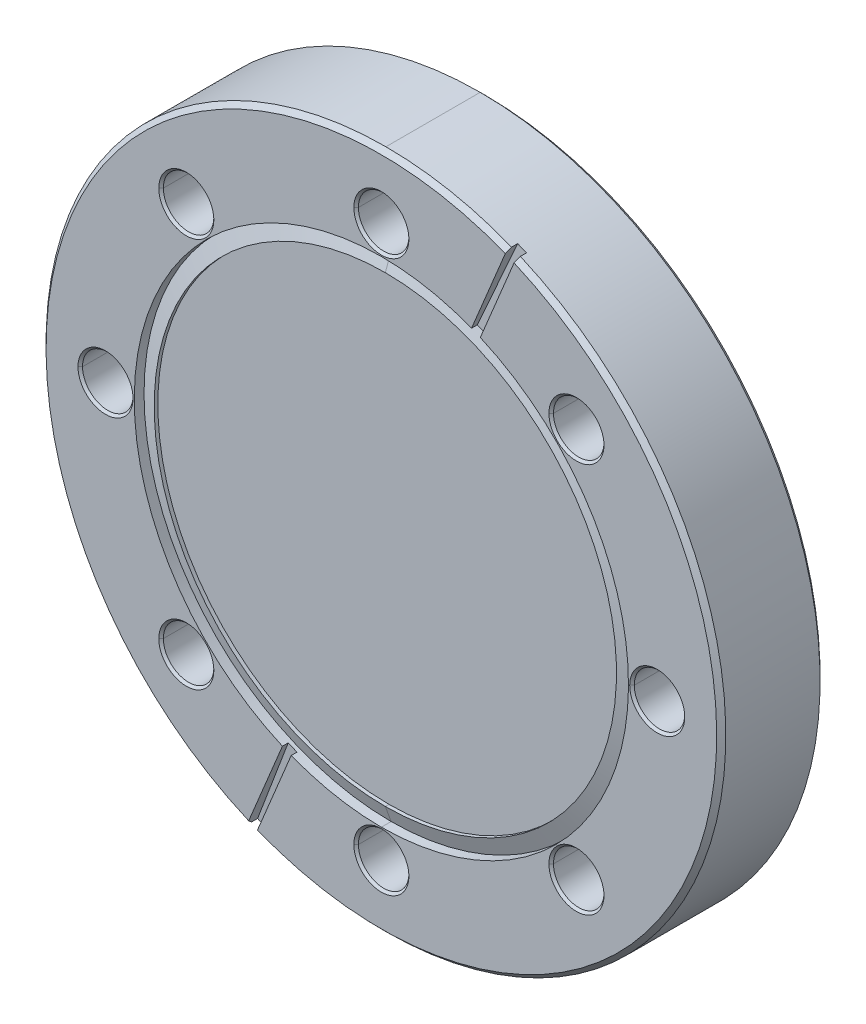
ISO-10303-21;
HEADER;
FILE_DESCRIPTION(('STEP AP214'),'2;1');
FILE_NAME('part.step','',(''),(''),'','','');
FILE_SCHEMA(('AUTOMOTIVE_DESIGN { 1 0 10303 214 1 1 1 1 }'));
ENDSEC;
DATA;
#1=APPLICATION_CONTEXT('core data for automotive mechanical design processes');
#2=APPLICATION_PROTOCOL_DEFINITION('international standard','automotive_design',2000,#1);
#3=PRODUCT_CONTEXT('',#1,'mechanical');
#4=PRODUCT('Part','Part','',(#3));
#5=PRODUCT_RELATED_PRODUCT_CATEGORY('part','',(#4));
#6=PRODUCT_DEFINITION_FORMATION('','',#4);
#7=PRODUCT_DEFINITION_CONTEXT('part definition',#1,'design');
#8=PRODUCT_DEFINITION('design','',#6,#7);
#9=PRODUCT_DEFINITION_SHAPE('','',#8);
#10=(LENGTH_UNIT() NAMED_UNIT(*) SI_UNIT(.MILLI.,.METRE.));
#11=(NAMED_UNIT(*) PLANE_ANGLE_UNIT() SI_UNIT($,.RADIAN.));
#12=(NAMED_UNIT(*) SI_UNIT($,.STERADIAN.) SOLID_ANGLE_UNIT());
#13=UNCERTAINTY_MEASURE_WITH_UNIT(LENGTH_MEASURE(1.E-05),#10,'distance_accuracy_value','');
#14=(GEOMETRIC_REPRESENTATION_CONTEXT(3) GLOBAL_UNCERTAINTY_ASSIGNED_CONTEXT((#13)) GLOBAL_UNIT_ASSIGNED_CONTEXT((#10,
#11,#12)) REPRESENTATION_CONTEXT('',''));
#15=CARTESIAN_POINT('',(0.,0.,0.));
#16=DIRECTION('',(0.,0.,1.));
#17=DIRECTION('',(1.,0.,0.));
#18=AXIS2_PLACEMENT_3D('',#15,#16,#17);
#19=CARTESIAN_POINT('',(-32.5803692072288,32.5803692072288,0.));
#20=DIRECTION('',(0.,0.,-1.));
#21=DIRECTION('',(-1.,0.,0.));
#22=AXIS2_PLACEMENT_3D('',#19,#20,#21);
#23=CYLINDRICAL_SURFACE('',#22,4.2164);
#24=DIRECTION('',(0.,0.,-1.));
#25=VECTOR('',#24,1.);
#26=CARTESIAN_POINT('',(-36.7967692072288,32.5803692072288,-0.381));
#27=LINE('',#26,#25);
#28=CARTESIAN_POINT('',(-36.7967692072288,32.5803692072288,-0.381));
#29=VERTEX_POINT('',#28);
#30=CARTESIAN_POINT('',(-36.7967692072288,32.5803692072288,-16.891));
#31=VERTEX_POINT('',#30);
#32=EDGE_CURVE('E921',#29,#31,#27,.T.);
#33=ORIENTED_EDGE('',*,*,#32,.T.);
#34=CARTESIAN_POINT('',(-32.5803692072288,32.5803692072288,-16.891));
#35=DIRECTION('',(0.,0.,-1.));
#36=DIRECTION('',(-1.,0.,0.));
#37=AXIS2_PLACEMENT_3D('',#34,#35,#36);
#38=CIRCLE('',#37,4.2164);
#39=CARTESIAN_POINT('',(-28.3639692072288,32.5803692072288,-16.891));
#40=VERTEX_POINT('',#39);
#41=EDGE_CURVE('E653',#31,#40,#38,.T.);
#42=ORIENTED_EDGE('',*,*,#41,.T.);
#43=DIRECTION('',(0.,0.,-1.));
#44=VECTOR('',#43,1.);
#45=CARTESIAN_POINT('',(-28.3639692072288,32.5803692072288,-0.381));
#46=LINE('',#45,#44);
#47=CARTESIAN_POINT('',(-28.3639692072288,32.5803692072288,-0.381));
#48=VERTEX_POINT('',#47);
#49=EDGE_CURVE('E883',#48,#40,#46,.T.);
#50=ORIENTED_EDGE('',*,*,#49,.F.);
#51=CARTESIAN_POINT('',(-32.5803692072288,32.5803692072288,-0.381));
#52=DIRECTION('',(0.,0.,-1.));
#53=DIRECTION('',(-1.,0.,0.));
#54=AXIS2_PLACEMENT_3D('',#51,#52,#53);
#55=CIRCLE('',#54,4.2164);
#56=EDGE_CURVE('E9',#29,#48,#55,.T.);
#57=ORIENTED_EDGE('',*,*,#56,.F.);
#58=EDGE_LOOP('',(#33,#42,#50,#57));
#59=FACE_BOUND('',#58,.T.);
#60=ADVANCED_FACE('F14',(#59),#23,.F.);
#61=CARTESIAN_POINT('',(-32.5803692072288,32.5803692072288,-0.1905));
#62=DIRECTION('',(0.,0.,1.));
#63=DIRECTION('',(1.,0.,0.));
#64=AXIS2_PLACEMENT_3D('',#61,#62,#63);
#65=CONICAL_SURFACE('',#64,4.4069,0.7853981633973);
#66=DIRECTION('',(0.707106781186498,0.,-0.707106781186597));
#67=VECTOR('',#66,1.);
#68=CARTESIAN_POINT('',(-37.1777692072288,32.5803692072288,0.));
#69=LINE('',#68,#67);
#70=CARTESIAN_POINT('',(-37.1777692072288,32.5803692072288,0.));
#71=VERTEX_POINT('',#70);
#72=EDGE_CURVE('E25',#71,#29,#69,.T.);
#73=ORIENTED_EDGE('',*,*,#72,.T.);
#74=ORIENTED_EDGE('',*,*,#56,.T.);
#75=DIRECTION('',(-0.707106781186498,0.,-0.707106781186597));
#76=VECTOR('',#75,1.);
#77=CARTESIAN_POINT('',(-27.9829692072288,32.5803692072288,0.));
#78=LINE('',#77,#76);
#79=CARTESIAN_POINT('',(-27.9829692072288,32.5803692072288,0.));
#80=VERTEX_POINT('',#79);
#81=EDGE_CURVE('E18',#80,#48,#78,.T.);
#82=ORIENTED_EDGE('',*,*,#81,.F.);
#83=CARTESIAN_POINT('',(-32.5803692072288,32.5803692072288,0.));
#84=DIRECTION('',(0.,0.,-1.));
#85=DIRECTION('',(-1.,0.,0.));
#86=AXIS2_PLACEMENT_3D('',#83,#84,#85);
#87=CIRCLE('',#86,4.5974);
#88=EDGE_CURVE('E407',#71,#80,#87,.T.);
#89=ORIENTED_EDGE('',*,*,#88,.F.);
#90=EDGE_LOOP('',(#73,#74,#82,#89));
#91=FACE_BOUND('',#90,.T.);
#92=ADVANCED_FACE('F950',(#91),#65,.F.);
#93=CARTESIAN_POINT('',(-32.5803692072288,32.5803692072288,-0.1905));
#94=DIRECTION('',(0.,0.,1.));
#95=DIRECTION('',(1.,0.,0.));
#96=AXIS2_PLACEMENT_3D('',#93,#94,#95);
#97=CONICAL_SURFACE('',#96,4.4069,0.7853981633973);
#98=ORIENTED_EDGE('',*,*,#81,.T.);
#99=CARTESIAN_POINT('',(-32.5803692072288,32.5803692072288,-0.381));
#100=DIRECTION('',(0.,0.,-1.));
#101=DIRECTION('',(1.,0.,0.));
#102=AXIS2_PLACEMENT_3D('',#99,#100,#101);
#103=CIRCLE('',#102,4.2164);
#104=EDGE_CURVE('E926',#48,#29,#103,.T.);
#105=ORIENTED_EDGE('',*,*,#104,.T.);
#106=ORIENTED_EDGE('',*,*,#72,.F.);
#107=CARTESIAN_POINT('',(-32.5803692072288,32.5803692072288,0.));
#108=DIRECTION('',(0.,0.,-1.));
#109=DIRECTION('',(1.,0.,0.));
#110=AXIS2_PLACEMENT_3D('',#107,#108,#109);
#111=CIRCLE('',#110,4.5974);
#112=EDGE_CURVE('E624',#80,#71,#111,.T.);
#113=ORIENTED_EDGE('',*,*,#112,.F.);
#114=EDGE_LOOP('',(#98,#105,#106,#113));
#115=FACE_BOUND('',#114,.T.);
#116=ADVANCED_FACE('F947',(#115),#97,.F.);
#117=CARTESIAN_POINT('',(-32.5803692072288,32.5803692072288,0.));
#118=DIRECTION('',(0.,0.,-1.));
#119=DIRECTION('',(-1.,0.,0.));
#120=AXIS2_PLACEMENT_3D('',#117,#118,#119);
#121=CYLINDRICAL_SURFACE('',#120,4.2164);
#122=ORIENTED_EDGE('',*,*,#49,.T.);
#123=CARTESIAN_POINT('',(-32.5803692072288,32.5803692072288,-16.891));
#124=DIRECTION('',(0.,0.,-1.));
#125=DIRECTION('',(1.,0.,0.));
#126=AXIS2_PLACEMENT_3D('',#123,#124,#125);
#127=CIRCLE('',#126,4.2164);
#128=EDGE_CURVE('E879',#40,#31,#127,.T.);
#129=ORIENTED_EDGE('',*,*,#128,.T.);
#130=ORIENTED_EDGE('',*,*,#32,.F.);
#131=ORIENTED_EDGE('',*,*,#104,.F.);
#132=EDGE_LOOP('',(#122,#129,#130,#131));
#133=FACE_BOUND('',#132,.T.);
#134=ADVANCED_FACE('F970',(#133),#121,.F.);
#135=CARTESIAN_POINT('',(-32.5803692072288,32.5803692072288,-17.0815));
#136=DIRECTION('',(0.,0.,-1.));
#137=DIRECTION('',(-1.,0.,0.));
#138=AXIS2_PLACEMENT_3D('',#135,#136,#137);
#139=CONICAL_SURFACE('',#138,4.4069,0.7853981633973);
#140=DIRECTION('',(0.707106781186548,0.,0.707106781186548));
#141=VECTOR('',#140,1.);
#142=CARTESIAN_POINT('',(-37.1777692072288,32.5803692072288,-17.272));
#143=LINE('',#142,#141);
#144=CARTESIAN_POINT('',(-37.1777692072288,32.5803692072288,-17.272));
#145=VERTEX_POINT('',#144);
#146=EDGE_CURVE('E657',#145,#31,#143,.T.);
#147=ORIENTED_EDGE('',*,*,#146,.T.);
#148=ORIENTED_EDGE('',*,*,#128,.F.);
#149=DIRECTION('',(-0.707106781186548,0.,0.707106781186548));
#150=VECTOR('',#149,1.);
#151=CARTESIAN_POINT('',(-27.9829692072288,32.5803692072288,-17.272));
#152=LINE('',#151,#150);
#153=CARTESIAN_POINT('',(-27.9829692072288,32.5803692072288,-17.272));
#154=VERTEX_POINT('',#153);
#155=EDGE_CURVE('E507',#154,#40,#152,.T.);
#156=ORIENTED_EDGE('',*,*,#155,.F.);
#157=CARTESIAN_POINT('',(-32.5803692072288,32.5803692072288,-17.272));
#158=DIRECTION('',(0.,0.,-1.));
#159=DIRECTION('',(1.,0.,0.));
#160=AXIS2_PLACEMENT_3D('',#157,#158,#159);
#161=CIRCLE('',#160,4.5974);
#162=EDGE_CURVE('E634',#154,#145,#161,.T.);
#163=ORIENTED_EDGE('',*,*,#162,.T.);
#164=EDGE_LOOP('',(#147,#148,#156,#163));
#165=FACE_BOUND('',#164,.T.);
#166=ADVANCED_FACE('F975',(#165),#139,.F.);
#167=CARTESIAN_POINT('',(-32.5803692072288,32.5803692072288,-17.0815));
#168=DIRECTION('',(0.,0.,-1.));
#169=DIRECTION('',(-1.,0.,0.));
#170=AXIS2_PLACEMENT_3D('',#167,#168,#169);
#171=CONICAL_SURFACE('',#170,4.4069,0.7853981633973);
#172=ORIENTED_EDGE('',*,*,#155,.T.);
#173=ORIENTED_EDGE('',*,*,#41,.F.);
#174=ORIENTED_EDGE('',*,*,#146,.F.);
#175=CARTESIAN_POINT('',(-32.5803692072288,32.5803692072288,-17.272));
#176=DIRECTION('',(0.,0.,-1.));
#177=DIRECTION('',(-1.,0.,0.));
#178=AXIS2_PLACEMENT_3D('',#175,#176,#177);
#179=CIRCLE('',#178,4.5974);
#180=EDGE_CURVE('E629',#145,#154,#179,.T.);
#181=ORIENTED_EDGE('',*,*,#180,.T.);
#182=EDGE_LOOP('',(#172,#173,#174,#181));
#183=FACE_BOUND('',#182,.T.);
#184=ADVANCED_FACE('F1122',(#183),#171,.F.);
#185=CARTESIAN_POINT('',(-46.0756,0.,0.));
#186=DIRECTION('',(0.,0.,-1.));
#187=DIRECTION('',(-1.,0.,0.));
#188=AXIS2_PLACEMENT_3D('',#185,#186,#187);
#189=CYLINDRICAL_SURFACE('',#188,4.2164);
#190=DIRECTION('',(0.,0.,-1.));
#191=VECTOR('',#190,1.);
#192=CARTESIAN_POINT('',(-50.292,0.,-0.381));
#193=LINE('',#192,#191);
#194=CARTESIAN_POINT('',(-50.292,0.,-0.381));
#195=VERTEX_POINT('',#194);
#196=CARTESIAN_POINT('',(-50.292,0.,-16.891));
#197=VERTEX_POINT('',#196);
#198=EDGE_CURVE('E700',#195,#197,#193,.T.);
#199=ORIENTED_EDGE('',*,*,#198,.T.);
#200=CARTESIAN_POINT('',(-46.0756,0.,-16.891));
#201=DIRECTION('',(0.,0.,-1.));
#202=DIRECTION('',(-1.,0.,0.));
#203=AXIS2_PLACEMENT_3D('',#200,#201,#202);
#204=CIRCLE('',#203,4.2164);
#205=CARTESIAN_POINT('',(-41.8592,0.,-16.891));
#206=VERTEX_POINT('',#205);
#207=EDGE_CURVE('E643',#197,#206,#204,.T.);
#208=ORIENTED_EDGE('',*,*,#207,.T.);
#209=DIRECTION('',(0.,0.,-1.));
#210=VECTOR('',#209,1.);
#211=CARTESIAN_POINT('',(-41.8592,0.,-0.381));
#212=LINE('',#211,#210);
#213=CARTESIAN_POINT('',(-41.8592,0.,-0.381));
#214=VERTEX_POINT('',#213);
#215=EDGE_CURVE('E746',#214,#206,#212,.T.);
#216=ORIENTED_EDGE('',*,*,#215,.F.);
#217=CARTESIAN_POINT('',(-46.0756,0.,-0.381));
#218=DIRECTION('',(0.,0.,-1.));
#219=DIRECTION('',(-1.,0.,0.));
#220=AXIS2_PLACEMENT_3D('',#217,#218,#219);
#221=CIRCLE('',#220,4.2164);
#222=EDGE_CURVE('E504',#195,#214,#221,.T.);
#223=ORIENTED_EDGE('',*,*,#222,.F.);
#224=EDGE_LOOP('',(#199,#208,#216,#223));
#225=FACE_BOUND('',#224,.T.);
#226=ADVANCED_FACE('F1116',(#225),#189,.F.);
#227=CARTESIAN_POINT('',(-46.0756,0.,-0.1905));
#228=DIRECTION('',(0.,0.,1.));
#229=DIRECTION('',(1.,0.,0.));
#230=AXIS2_PLACEMENT_3D('',#227,#228,#229);
#231=CONICAL_SURFACE('',#230,4.4069,0.7853981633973);
#232=DIRECTION('',(0.707106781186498,0.,-0.707106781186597));
#233=VECTOR('',#232,1.);
#234=CARTESIAN_POINT('',(-50.673,0.,0.));
#235=LINE('',#234,#233);
#236=CARTESIAN_POINT('',(-50.673,0.,0.));
#237=VERTEX_POINT('',#236);
#238=EDGE_CURVE('E508',#237,#195,#235,.T.);
#239=ORIENTED_EDGE('',*,*,#238,.T.);
#240=ORIENTED_EDGE('',*,*,#222,.T.);
#241=DIRECTION('',(-0.707106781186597,0.,-0.707106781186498));
#242=VECTOR('',#241,1.);
#243=CARTESIAN_POINT('',(-41.4782,0.,0.));
#244=LINE('',#243,#242);
#245=CARTESIAN_POINT('',(-41.4782,0.,0.));
#246=VERTEX_POINT('',#245);
#247=EDGE_CURVE('E515',#246,#214,#244,.T.);
#248=ORIENTED_EDGE('',*,*,#247,.F.);
#249=CARTESIAN_POINT('',(-46.0756,0.,0.));
#250=DIRECTION('',(0.,0.,-1.));
#251=DIRECTION('',(-1.,0.,0.));
#252=AXIS2_PLACEMENT_3D('',#249,#250,#251);
#253=CIRCLE('',#252,4.5974);
#254=EDGE_CURVE('E620',#237,#246,#253,.T.);
#255=ORIENTED_EDGE('',*,*,#254,.F.);
#256=EDGE_LOOP('',(#239,#240,#248,#255));
#257=FACE_BOUND('',#256,.T.);
#258=ADVANCED_FACE('F1121',(#257),#231,.F.);
#259=CARTESIAN_POINT('',(-46.0756,0.,-0.1905));
#260=DIRECTION('',(0.,0.,1.));
#261=DIRECTION('',(1.,0.,0.));
#262=AXIS2_PLACEMENT_3D('',#259,#260,#261);
#263=CONICAL_SURFACE('',#262,4.4069,0.7853981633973);
#264=ORIENTED_EDGE('',*,*,#247,.T.);
#265=CARTESIAN_POINT('',(-46.0756,0.,-0.381));
#266=DIRECTION('',(0.,0.,-1.));
#267=DIRECTION('',(1.,0.,0.));
#268=AXIS2_PLACEMENT_3D('',#265,#266,#267);
#269=CIRCLE('',#268,4.2164);
#270=EDGE_CURVE('E519',#214,#195,#269,.T.);
#271=ORIENTED_EDGE('',*,*,#270,.T.);
#272=ORIENTED_EDGE('',*,*,#238,.F.);
#273=CARTESIAN_POINT('',(-46.0756,0.,0.));
#274=DIRECTION('',(0.,0.,-1.));
#275=DIRECTION('',(1.,0.,0.));
#276=AXIS2_PLACEMENT_3D('',#273,#274,#275);
#277=CIRCLE('',#276,4.5974);
#278=EDGE_CURVE('E625',#246,#237,#277,.T.);
#279=ORIENTED_EDGE('',*,*,#278,.F.);
#280=EDGE_LOOP('',(#264,#271,#272,#279));
#281=FACE_BOUND('',#280,.T.);
#282=ADVANCED_FACE('F1246',(#281),#263,.F.);
#283=CARTESIAN_POINT('',(-46.0756,0.,0.));
#284=DIRECTION('',(0.,0.,-1.));
#285=DIRECTION('',(-1.,0.,0.));
#286=AXIS2_PLACEMENT_3D('',#283,#284,#285);
#287=CYLINDRICAL_SURFACE('',#286,4.2164);
#288=ORIENTED_EDGE('',*,*,#215,.T.);
#289=CARTESIAN_POINT('',(-46.0756,0.,-16.891));
#290=DIRECTION('',(0.,0.,-1.));
#291=DIRECTION('',(1.,0.,0.));
#292=AXIS2_PLACEMENT_3D('',#289,#290,#291);
#293=CIRCLE('',#292,4.2164);
#294=EDGE_CURVE('E642',#206,#197,#293,.T.);
#295=ORIENTED_EDGE('',*,*,#294,.T.);
#296=ORIENTED_EDGE('',*,*,#198,.F.);
#297=ORIENTED_EDGE('',*,*,#270,.F.);
#298=EDGE_LOOP('',(#288,#295,#296,#297));
#299=FACE_BOUND('',#298,.T.);
#300=ADVANCED_FACE('F1235',(#299),#287,.F.);
#301=CARTESIAN_POINT('',(-46.0756,0.,-17.0815));
#302=DIRECTION('',(0.,0.,-1.));
#303=DIRECTION('',(-1.,0.,0.));
#304=AXIS2_PLACEMENT_3D('',#301,#302,#303);
#305=CONICAL_SURFACE('',#304,4.4069,0.7853981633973);
#306=DIRECTION('',(0.707106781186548,0.,0.707106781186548));
#307=VECTOR('',#306,1.);
#308=CARTESIAN_POINT('',(-50.673,0.,-17.272));
#309=LINE('',#308,#307);
#310=CARTESIAN_POINT('',(-50.673,0.,-17.272));
#311=VERTEX_POINT('',#310);
#312=EDGE_CURVE('E638',#311,#197,#309,.T.);
#313=ORIENTED_EDGE('',*,*,#312,.T.);
#314=ORIENTED_EDGE('',*,*,#294,.F.);
#315=DIRECTION('',(-0.707106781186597,0.,0.707106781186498));
#316=VECTOR('',#315,1.);
#317=CARTESIAN_POINT('',(-41.4782,0.,-17.272));
#318=LINE('',#317,#316);
#319=CARTESIAN_POINT('',(-41.4782,0.,-17.272));
#320=VERTEX_POINT('',#319);
#321=EDGE_CURVE('E738',#320,#206,#318,.T.);
#322=ORIENTED_EDGE('',*,*,#321,.F.);
#323=CARTESIAN_POINT('',(-46.0756,0.,-17.272));
#324=DIRECTION('',(0.,0.,-1.));
#325=DIRECTION('',(1.,0.,0.));
#326=AXIS2_PLACEMENT_3D('',#323,#324,#325);
#327=CIRCLE('',#326,4.5974);
#328=EDGE_CURVE('E648',#320,#311,#327,.T.);
#329=ORIENTED_EDGE('',*,*,#328,.T.);
#330=EDGE_LOOP('',(#313,#314,#322,#329));
#331=FACE_BOUND('',#330,.T.);
#332=ADVANCED_FACE('F1229',(#331),#305,.F.);
#333=CARTESIAN_POINT('',(-46.0756,0.,-17.0815));
#334=DIRECTION('',(0.,0.,-1.));
#335=DIRECTION('',(-1.,0.,0.));
#336=AXIS2_PLACEMENT_3D('',#333,#334,#335);
#337=CONICAL_SURFACE('',#336,4.4069,0.7853981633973);
#338=ORIENTED_EDGE('',*,*,#321,.T.);
#339=ORIENTED_EDGE('',*,*,#207,.F.);
#340=ORIENTED_EDGE('',*,*,#312,.F.);
#341=CARTESIAN_POINT('',(-46.0756,0.,-17.272));
#342=DIRECTION('',(0.,0.,-1.));
#343=DIRECTION('',(-1.,0.,0.));
#344=AXIS2_PLACEMENT_3D('',#341,#342,#343);
#345=CIRCLE('',#344,4.5974);
#346=EDGE_CURVE('E804',#311,#320,#345,.T.);
#347=ORIENTED_EDGE('',*,*,#346,.T.);
#348=EDGE_LOOP('',(#338,#339,#340,#347));
#349=FACE_BOUND('',#348,.T.);
#350=ADVANCED_FACE('F1234',(#349),#337,.F.);
#351=CARTESIAN_POINT('',(-32.5803692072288,-32.5803692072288,0.));
#352=DIRECTION('',(0.,0.,-1.));
#353=DIRECTION('',(-1.,0.,0.));
#354=AXIS2_PLACEMENT_3D('',#351,#352,#353);
#355=CYLINDRICAL_SURFACE('',#354,4.2164);
#356=DIRECTION('',(0.,0.,-1.));
#357=VECTOR('',#356,1.);
#358=CARTESIAN_POINT('',(-36.7967692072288,-32.5803692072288,-0.381));
#359=LINE('',#358,#357);
#360=CARTESIAN_POINT('',(-36.7967692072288,-32.5803692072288,-0.381));
#361=VERTEX_POINT('',#360);
#362=CARTESIAN_POINT('',(-36.7967692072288,-32.5803692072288,-16.891));
#363=VERTEX_POINT('',#362);
#364=EDGE_CURVE('E696',#361,#363,#359,.T.);
#365=ORIENTED_EDGE('',*,*,#364,.T.);
#366=CARTESIAN_POINT('',(-32.5803692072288,-32.5803692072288,-16.891));
#367=DIRECTION('',(0.,0.,-1.));
#368=DIRECTION('',(-1.,0.,0.));
#369=AXIS2_PLACEMENT_3D('',#366,#367,#368);
#370=CIRCLE('',#369,4.2164);
#371=CARTESIAN_POINT('',(-28.3639692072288,-32.5803692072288,-16.891));
#372=VERTEX_POINT('',#371);
#373=EDGE_CURVE('E464',#363,#372,#370,.T.);
#374=ORIENTED_EDGE('',*,*,#373,.T.);
#375=DIRECTION('',(0.,0.,-1.));
#376=VECTOR('',#375,1.);
#377=CARTESIAN_POINT('',(-28.3639692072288,-32.5803692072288,-0.381));
#378=LINE('',#377,#376);
#379=CARTESIAN_POINT('',(-28.3639692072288,-32.5803692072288,-0.381));
#380=VERTEX_POINT('',#379);
#381=EDGE_CURVE('E900',#380,#372,#378,.T.);
#382=ORIENTED_EDGE('',*,*,#381,.F.);
#383=CARTESIAN_POINT('',(-32.5803692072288,-32.5803692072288,-0.381));
#384=DIRECTION('',(0.,0.,-1.));
#385=DIRECTION('',(-1.,0.,0.));
#386=AXIS2_PLACEMENT_3D('',#383,#384,#385);
#387=CIRCLE('',#386,4.2164);
#388=EDGE_CURVE('E735',#361,#380,#387,.T.);
#389=ORIENTED_EDGE('',*,*,#388,.F.);
#390=EDGE_LOOP('',(#365,#374,#382,#389));
#391=FACE_BOUND('',#390,.T.);
#392=ADVANCED_FACE('F1497',(#391),#355,.F.);
#393=CARTESIAN_POINT('',(-32.5803692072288,-32.5803692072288,-0.1905));
#394=DIRECTION('',(0.,0.,1.));
#395=DIRECTION('',(1.,0.,0.));
#396=AXIS2_PLACEMENT_3D('',#393,#394,#395);
#397=CONICAL_SURFACE('',#396,4.4069,0.7853981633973);
#398=DIRECTION('',(0.707106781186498,0.,-0.707106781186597));
#399=VECTOR('',#398,1.);
#400=CARTESIAN_POINT('',(-37.1777692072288,-32.5803692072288,0.));
#401=LINE('',#400,#399);
#402=CARTESIAN_POINT('',(-37.1777692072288,-32.5803692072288,0.));
#403=VERTEX_POINT('',#402);
#404=EDGE_CURVE('E739',#403,#361,#401,.T.);
#405=ORIENTED_EDGE('',*,*,#404,.T.);
#406=ORIENTED_EDGE('',*,*,#388,.T.);
#407=DIRECTION('',(-0.707106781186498,0.,-0.707106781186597));
#408=VECTOR('',#407,1.);
#409=CARTESIAN_POINT('',(-27.9829692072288,-32.5803692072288,0.));
#410=LINE('',#409,#408);
#411=CARTESIAN_POINT('',(-27.9829692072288,-32.5803692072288,0.));
#412=VERTEX_POINT('',#411);
#413=EDGE_CURVE('E695',#412,#380,#410,.T.);
#414=ORIENTED_EDGE('',*,*,#413,.F.);
#415=CARTESIAN_POINT('',(-32.5803692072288,-32.5803692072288,0.));
#416=DIRECTION('',(0.,0.,-1.));
#417=DIRECTION('',(-1.,0.,0.));
#418=AXIS2_PLACEMENT_3D('',#415,#416,#417);
#419=CIRCLE('',#418,4.5974);
#420=EDGE_CURVE('E925',#403,#412,#419,.T.);
#421=ORIENTED_EDGE('',*,*,#420,.F.);
#422=EDGE_LOOP('',(#405,#406,#414,#421));
#423=FACE_BOUND('',#422,.T.);
#424=ADVANCED_FACE('F1360',(#423),#397,.F.);
#425=CARTESIAN_POINT('',(-32.5803692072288,-32.5803692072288,-0.1905));
#426=DIRECTION('',(0.,0.,1.));
#427=DIRECTION('',(1.,0.,0.));
#428=AXIS2_PLACEMENT_3D('',#425,#426,#427);
#429=CONICAL_SURFACE('',#428,4.4069,0.7853981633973);
#430=ORIENTED_EDGE('',*,*,#413,.T.);
#431=CARTESIAN_POINT('',(-32.5803692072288,-32.5803692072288,-0.381));
#432=DIRECTION('',(0.,0.,-1.));
#433=DIRECTION('',(1.,0.,0.));
#434=AXIS2_PLACEMENT_3D('',#431,#432,#433);
#435=CIRCLE('',#434,4.2164);
#436=EDGE_CURVE('E691',#380,#361,#435,.T.);
#437=ORIENTED_EDGE('',*,*,#436,.T.);
#438=ORIENTED_EDGE('',*,*,#404,.F.);
#439=CARTESIAN_POINT('',(-32.5803692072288,-32.5803692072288,0.));
#440=DIRECTION('',(0.,0.,-1.));
#441=DIRECTION('',(1.,0.,0.));
#442=AXIS2_PLACEMENT_3D('',#439,#440,#441);
#443=CIRCLE('',#442,4.5974);
#444=EDGE_CURVE('E415',#412,#403,#443,.T.);
#445=ORIENTED_EDGE('',*,*,#444,.F.);
#446=EDGE_LOOP('',(#430,#437,#438,#445));
#447=FACE_BOUND('',#446,.T.);
#448=ADVANCED_FACE('F1333',(#447),#429,.F.);
#449=CARTESIAN_POINT('',(-32.5803692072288,-32.5803692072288,0.));
#450=DIRECTION('',(0.,0.,-1.));
#451=DIRECTION('',(-1.,0.,0.));
#452=AXIS2_PLACEMENT_3D('',#449,#450,#451);
#453=CYLINDRICAL_SURFACE('',#452,4.2164);
#454=ORIENTED_EDGE('',*,*,#381,.T.);
#455=CARTESIAN_POINT('',(-32.5803692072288,-32.5803692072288,-16.891));
#456=DIRECTION('',(0.,0.,-1.));
#457=DIRECTION('',(1.,0.,0.));
#458=AXIS2_PLACEMENT_3D('',#455,#456,#457);
#459=CIRCLE('',#458,4.2164);
#460=EDGE_CURVE('E896',#372,#363,#459,.T.);
#461=ORIENTED_EDGE('',*,*,#460,.T.);
#462=ORIENTED_EDGE('',*,*,#364,.F.);
#463=ORIENTED_EDGE('',*,*,#436,.F.);
#464=EDGE_LOOP('',(#454,#461,#462,#463));
#465=FACE_BOUND('',#464,.T.);
#466=ADVANCED_FACE('F1328',(#465),#453,.F.);
#467=CARTESIAN_POINT('',(-32.5803692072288,-32.5803692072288,-17.0815));
#468=DIRECTION('',(0.,0.,-1.));
#469=DIRECTION('',(-1.,0.,0.));
#470=AXIS2_PLACEMENT_3D('',#467,#468,#469);
#471=CONICAL_SURFACE('',#470,4.4069,0.7853981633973);
#472=DIRECTION('',(0.707106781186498,0.,0.707106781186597));
#473=VECTOR('',#472,1.);
#474=CARTESIAN_POINT('',(-37.1777692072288,-32.5803692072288,-17.272));
#475=LINE('',#474,#473);
#476=CARTESIAN_POINT('',(-37.1777692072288,-32.5803692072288,-17.272));
#477=VERTEX_POINT('',#476);
#478=EDGE_CURVE('E901',#477,#363,#475,.T.);
#479=ORIENTED_EDGE('',*,*,#478,.T.);
#480=ORIENTED_EDGE('',*,*,#460,.F.);
#481=DIRECTION('',(-0.707106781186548,0.,0.707106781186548));
#482=VECTOR('',#481,1.);
#483=CARTESIAN_POINT('',(-27.9829692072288,-32.5803692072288,-17.272));
#484=LINE('',#483,#482);
#485=CARTESIAN_POINT('',(-27.9829692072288,-32.5803692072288,-17.272));
#486=VERTEX_POINT('',#485);
#487=EDGE_CURVE('E460',#486,#372,#484,.T.);
#488=ORIENTED_EDGE('',*,*,#487,.F.);
#489=CARTESIAN_POINT('',(-32.5803692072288,-32.5803692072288,-17.272));
#490=DIRECTION('',(0.,0.,-1.));
#491=DIRECTION('',(1.,0.,0.));
#492=AXIS2_PLACEMENT_3D('',#489,#490,#491);
#493=CIRCLE('',#492,4.5974);
#494=EDGE_CURVE('E649',#486,#477,#493,.T.);
#495=ORIENTED_EDGE('',*,*,#494,.T.);
#496=EDGE_LOOP('',(#479,#480,#488,#495));
#497=FACE_BOUND('',#496,.T.);
#498=ADVANCED_FACE('F1143',(#497),#471,.F.);
#499=CARTESIAN_POINT('',(-32.5803692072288,-32.5803692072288,-17.0815));
#500=DIRECTION('',(0.,0.,-1.));
#501=DIRECTION('',(-1.,0.,0.));
#502=AXIS2_PLACEMENT_3D('',#499,#500,#501);
#503=CONICAL_SURFACE('',#502,4.4069,0.7853981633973);
#504=ORIENTED_EDGE('',*,*,#487,.T.);
#505=ORIENTED_EDGE('',*,*,#373,.F.);
#506=ORIENTED_EDGE('',*,*,#478,.F.);
#507=CARTESIAN_POINT('',(-32.5803692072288,-32.5803692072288,-17.272));
#508=DIRECTION('',(0.,0.,-1.));
#509=DIRECTION('',(-1.,0.,0.));
#510=AXIS2_PLACEMENT_3D('',#507,#508,#509);
#511=CIRCLE('',#510,4.5974);
#512=EDGE_CURVE('E644',#477,#486,#511,.T.);
#513=ORIENTED_EDGE('',*,*,#512,.T.);
#514=EDGE_LOOP('',(#504,#505,#506,#513));
#515=FACE_BOUND('',#514,.T.);
#516=ADVANCED_FACE('F1138',(#515),#503,.F.);
#517=CARTESIAN_POINT('',(0.,-46.0756,0.));
#518=DIRECTION('',(0.,0.,-1.));
#519=DIRECTION('',(-1.,0.,0.));
#520=AXIS2_PLACEMENT_3D('',#517,#518,#519);
#521=CYLINDRICAL_SURFACE('',#520,4.2164);
#522=DIRECTION('',(0.,0.,-1.));
#523=VECTOR('',#522,1.);
#524=CARTESIAN_POINT('',(-4.2164,-46.0756,-0.381));
#525=LINE('',#524,#523);
#526=CARTESIAN_POINT('',(-4.2164,-46.0756,-0.381));
#527=VERTEX_POINT('',#526);
#528=CARTESIAN_POINT('',(-4.2164,-46.0756,-16.891));
#529=VERTEX_POINT('',#528);
#530=EDGE_CURVE('E713',#527,#529,#525,.T.);
#531=ORIENTED_EDGE('',*,*,#530,.T.);
#532=CARTESIAN_POINT('',(0.,-46.0756,-16.891));
#533=DIRECTION('',(0.,0.,-1.));
#534=DIRECTION('',(-1.,0.,0.));
#535=AXIS2_PLACEMENT_3D('',#532,#533,#534);
#536=CIRCLE('',#535,4.2164);
#537=CARTESIAN_POINT('',(4.2164,-46.0756,-16.891));
#538=VERTEX_POINT('',#537);
#539=EDGE_CURVE('E719',#529,#538,#536,.T.);
#540=ORIENTED_EDGE('',*,*,#539,.T.);
#541=DIRECTION('',(0.,0.,-1.));
#542=VECTOR('',#541,1.);
#543=CARTESIAN_POINT('',(4.2164,-46.0756,-0.381));
#544=LINE('',#543,#542);
#545=CARTESIAN_POINT('',(4.2164,-46.0756,-0.381));
#546=VERTEX_POINT('',#545);
#547=EDGE_CURVE('E710',#546,#538,#544,.T.);
#548=ORIENTED_EDGE('',*,*,#547,.F.);
#549=CARTESIAN_POINT('',(0.,-46.0756,-0.381));
#550=DIRECTION('',(0.,0.,-1.));
#551=DIRECTION('',(-1.,0.,0.));
#552=AXIS2_PLACEMENT_3D('',#549,#550,#551);
#553=CIRCLE('',#552,4.2164);
#554=EDGE_CURVE('E465',#527,#546,#553,.T.);
#555=ORIENTED_EDGE('',*,*,#554,.F.);
#556=EDGE_LOOP('',(#531,#540,#548,#555));
#557=FACE_BOUND('',#556,.T.);
#558=ADVANCED_FACE('F1098',(#557),#521,.F.);
#559=CARTESIAN_POINT('',(0.,-46.0756,-0.1905));
#560=DIRECTION('',(0.,0.,1.));
#561=DIRECTION('',(1.,0.,0.));
#562=AXIS2_PLACEMENT_3D('',#559,#560,#561);
#563=CONICAL_SURFACE('',#562,4.4069,0.7853981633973);
#564=DIRECTION('',(0.707106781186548,0.,-0.707106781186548));
#565=VECTOR('',#564,1.);
#566=CARTESIAN_POINT('',(-4.5974,-46.0756,0.));
#567=LINE('',#566,#565);
#568=CARTESIAN_POINT('',(-4.5974,-46.0756,0.));
#569=VERTEX_POINT('',#568);
#570=EDGE_CURVE('E682',#569,#527,#567,.T.);
#571=ORIENTED_EDGE('',*,*,#570,.T.);
#572=ORIENTED_EDGE('',*,*,#554,.T.);
#573=DIRECTION('',(-0.707106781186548,0.,-0.707106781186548));
#574=VECTOR('',#573,1.);
#575=CARTESIAN_POINT('',(4.5974,-46.0756,0.));
#576=LINE('',#575,#574);
#577=CARTESIAN_POINT('',(4.5974,-46.0756,0.));
#578=VERTEX_POINT('',#577);
#579=EDGE_CURVE('E679',#578,#546,#576,.T.);
#580=ORIENTED_EDGE('',*,*,#579,.F.);
#581=CARTESIAN_POINT('',(0.,-46.0756,0.));
#582=DIRECTION('',(0.,0.,-1.));
#583=DIRECTION('',(-1.,0.,0.));
#584=AXIS2_PLACEMENT_3D('',#581,#582,#583);
#585=CIRCLE('',#584,4.5974);
#586=EDGE_CURVE('E552',#569,#578,#585,.T.);
#587=ORIENTED_EDGE('',*,*,#586,.F.);
#588=EDGE_LOOP('',(#571,#572,#580,#587));
#589=FACE_BOUND('',#588,.T.);
#590=ADVANCED_FACE('F1092',(#589),#563,.F.);
#591=CARTESIAN_POINT('',(0.,-46.0756,-0.1905));
#592=DIRECTION('',(0.,0.,1.));
#593=DIRECTION('',(1.,0.,0.));
#594=AXIS2_PLACEMENT_3D('',#591,#592,#593);
#595=CONICAL_SURFACE('',#594,4.4069,0.7853981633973);
#596=ORIENTED_EDGE('',*,*,#579,.T.);
#597=CARTESIAN_POINT('',(0.,-46.0756,-0.381));
#598=DIRECTION('',(0.,0.,-1.));
#599=DIRECTION('',(1.,0.,0.));
#600=AXIS2_PLACEMENT_3D('',#597,#598,#599);
#601=CIRCLE('',#600,4.2164);
#602=EDGE_CURVE('E683',#546,#527,#601,.T.);
#603=ORIENTED_EDGE('',*,*,#602,.T.);
#604=ORIENTED_EDGE('',*,*,#570,.F.);
#605=CARTESIAN_POINT('',(0.,-46.0756,0.));
#606=DIRECTION('',(0.,0.,-1.));
#607=DIRECTION('',(1.,0.,0.));
#608=AXIS2_PLACEMENT_3D('',#605,#606,#607);
#609=CIRCLE('',#608,4.5974);
#610=EDGE_CURVE('E715',#578,#569,#609,.T.);
#611=ORIENTED_EDGE('',*,*,#610,.F.);
#612=EDGE_LOOP('',(#596,#603,#604,#611));
#613=FACE_BOUND('',#612,.T.);
#614=ADVANCED_FACE('F1097',(#613),#595,.F.);
#615=CARTESIAN_POINT('',(0.,-46.0756,0.));
#616=DIRECTION('',(0.,0.,-1.));
#617=DIRECTION('',(-1.,0.,0.));
#618=AXIS2_PLACEMENT_3D('',#615,#616,#617);
#619=CYLINDRICAL_SURFACE('',#618,4.2164);
#620=ORIENTED_EDGE('',*,*,#547,.T.);
#621=CARTESIAN_POINT('',(0.,-46.0756,-16.891));
#622=DIRECTION('',(0.,0.,-1.));
#623=DIRECTION('',(1.,0.,0.));
#624=AXIS2_PLACEMENT_3D('',#621,#622,#623);
#625=CIRCLE('',#624,4.2164);
#626=EDGE_CURVE('E714',#538,#529,#625,.T.);
#627=ORIENTED_EDGE('',*,*,#626,.T.);
#628=ORIENTED_EDGE('',*,*,#530,.F.);
#629=ORIENTED_EDGE('',*,*,#602,.F.);
#630=EDGE_LOOP('',(#620,#627,#628,#629));
#631=FACE_BOUND('',#630,.T.);
#632=ADVANCED_FACE('F1212',(#631),#619,.F.);
#633=CARTESIAN_POINT('',(0.,-46.0756,-17.0815));
#634=DIRECTION('',(0.,0.,-1.));
#635=DIRECTION('',(-1.,0.,0.));
#636=AXIS2_PLACEMENT_3D('',#633,#634,#635);
#637=CONICAL_SURFACE('',#636,4.4069,0.7853981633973);
#638=DIRECTION('',(0.707106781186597,0.,0.707106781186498));
#639=VECTOR('',#638,1.);
#640=CARTESIAN_POINT('',(-4.5974,-46.0756,-17.272));
#641=LINE('',#640,#639);
#642=CARTESIAN_POINT('',(-4.5974,-46.0756,-17.272));
#643=VERTEX_POINT('',#642);
#644=EDGE_CURVE('E723',#643,#529,#641,.T.);
#645=ORIENTED_EDGE('',*,*,#644,.T.);
#646=ORIENTED_EDGE('',*,*,#626,.F.);
#647=DIRECTION('',(-0.707106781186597,0.,0.707106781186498));
#648=VECTOR('',#647,1.);
#649=CARTESIAN_POINT('',(4.5974,-46.0756,-17.272));
#650=LINE('',#649,#648);
#651=CARTESIAN_POINT('',(4.5974,-46.0756,-17.272));
#652=VERTEX_POINT('',#651);
#653=EDGE_CURVE('E724',#652,#538,#650,.T.);
#654=ORIENTED_EDGE('',*,*,#653,.F.);
#655=CARTESIAN_POINT('',(0.,-46.0756,-17.272));
#656=DIRECTION('',(0.,0.,-1.));
#657=DIRECTION('',(1.,0.,0.));
#658=AXIS2_PLACEMENT_3D('',#655,#656,#657);
#659=CIRCLE('',#658,4.5974);
#660=EDGE_CURVE('E667',#652,#643,#659,.T.);
#661=ORIENTED_EDGE('',*,*,#660,.T.);
#662=EDGE_LOOP('',(#645,#646,#654,#661));
#663=FACE_BOUND('',#662,.T.);
#664=ADVANCED_FACE('F1207',(#663),#637,.F.);
#665=CARTESIAN_POINT('',(0.,-46.0756,-17.0815));
#666=DIRECTION('',(0.,0.,-1.));
#667=DIRECTION('',(-1.,0.,0.));
#668=AXIS2_PLACEMENT_3D('',#665,#666,#667);
#669=CONICAL_SURFACE('',#668,4.4069,0.7853981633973);
#670=ORIENTED_EDGE('',*,*,#653,.T.);
#671=ORIENTED_EDGE('',*,*,#539,.F.);
#672=ORIENTED_EDGE('',*,*,#644,.F.);
#673=CARTESIAN_POINT('',(0.,-46.0756,-17.272));
#674=DIRECTION('',(0.,0.,-1.));
#675=DIRECTION('',(-1.,0.,0.));
#676=AXIS2_PLACEMENT_3D('',#673,#674,#675);
#677=CIRCLE('',#676,4.5974);
#678=EDGE_CURVE('E663',#643,#652,#677,.T.);
#679=ORIENTED_EDGE('',*,*,#678,.T.);
#680=EDGE_LOOP('',(#670,#671,#672,#679));
#681=FACE_BOUND('',#680,.T.);
#682=ADVANCED_FACE('F1190',(#681),#669,.F.);
#683=CARTESIAN_POINT('',(32.5803692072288,-32.5803692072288,0.));
#684=DIRECTION('',(0.,0.,-1.));
#685=DIRECTION('',(-1.,0.,0.));
#686=AXIS2_PLACEMENT_3D('',#683,#684,#685);
#687=CYLINDRICAL_SURFACE('',#686,4.2164);
#688=DIRECTION('',(0.,0.,-1.));
#689=VECTOR('',#688,1.);
#690=CARTESIAN_POINT('',(28.3639692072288,-32.5803692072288,-0.381));
#691=LINE('',#690,#689);
#692=CARTESIAN_POINT('',(28.3639692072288,-32.5803692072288,-0.381));
#693=VERTEX_POINT('',#692);
#694=CARTESIAN_POINT('',(28.3639692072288,-32.5803692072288,-16.891));
#695=VERTEX_POINT('',#694);
#696=EDGE_CURVE('E493',#693,#695,#691,.T.);
#697=ORIENTED_EDGE('',*,*,#696,.T.);
#698=CARTESIAN_POINT('',(32.5803692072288,-32.5803692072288,-16.891));
#699=DIRECTION('',(0.,0.,-1.));
#700=DIRECTION('',(-1.,0.,0.));
#701=AXIS2_PLACEMENT_3D('',#698,#699,#700);
#702=CIRCLE('',#701,4.2164);
#703=CARTESIAN_POINT('',(36.7967692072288,-32.5803692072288,-16.891));
#704=VERTEX_POINT('',#703);
#705=EDGE_CURVE('E572',#695,#704,#702,.T.);
#706=ORIENTED_EDGE('',*,*,#705,.T.);
#707=DIRECTION('',(0.,0.,-1.));
#708=VECTOR('',#707,1.);
#709=CARTESIAN_POINT('',(36.7967692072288,-32.5803692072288,-0.381));
#710=LINE('',#709,#708);
#711=CARTESIAN_POINT('',(36.7967692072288,-32.5803692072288,-0.381));
#712=VERTEX_POINT('',#711);
#713=EDGE_CURVE('E538',#712,#704,#710,.T.);
#714=ORIENTED_EDGE('',*,*,#713,.F.);
#715=CARTESIAN_POINT('',(32.5803692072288,-32.5803692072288,-0.381));
#716=DIRECTION('',(0.,0.,-1.));
#717=DIRECTION('',(-1.,0.,0.));
#718=AXIS2_PLACEMENT_3D('',#715,#716,#717);
#719=CIRCLE('',#718,4.2164);
#720=EDGE_CURVE('E673',#693,#712,#719,.T.);
#721=ORIENTED_EDGE('',*,*,#720,.F.);
#722=EDGE_LOOP('',(#697,#706,#714,#721));
#723=FACE_BOUND('',#722,.T.);
#724=ADVANCED_FACE('F1027',(#723),#687,.F.);
#725=CARTESIAN_POINT('',(32.5803692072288,-32.5803692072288,-0.1905));
#726=DIRECTION('',(0.,0.,1.));
#727=DIRECTION('',(1.,0.,0.));
#728=AXIS2_PLACEMENT_3D('',#725,#726,#727);
#729=CONICAL_SURFACE('',#728,4.4069,0.7853981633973);
#730=DIRECTION('',(0.707106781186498,0.,-0.707106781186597));
#731=VECTOR('',#730,1.);
#732=CARTESIAN_POINT('',(27.9829692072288,-32.5803692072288,0.));
#733=LINE('',#732,#731);
#734=CARTESIAN_POINT('',(27.9829692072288,-32.5803692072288,0.));
#735=VERTEX_POINT('',#734);
#736=EDGE_CURVE('E582',#735,#693,#733,.T.);
#737=ORIENTED_EDGE('',*,*,#736,.T.);
#738=ORIENTED_EDGE('',*,*,#720,.T.);
#739=DIRECTION('',(-0.707106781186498,0.,-0.707106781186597));
#740=VECTOR('',#739,1.);
#741=CARTESIAN_POINT('',(37.1777692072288,-32.5803692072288,0.));
#742=LINE('',#741,#740);
#743=CARTESIAN_POINT('',(37.1777692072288,-32.5803692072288,0.));
#744=VERTEX_POINT('',#743);
#745=EDGE_CURVE('E579',#744,#712,#742,.T.);
#746=ORIENTED_EDGE('',*,*,#745,.F.);
#747=CARTESIAN_POINT('',(32.5803692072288,-32.5803692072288,0.));
#748=DIRECTION('',(0.,0.,-1.));
#749=DIRECTION('',(-1.,0.,0.));
#750=AXIS2_PLACEMENT_3D('',#747,#748,#749);
#751=CIRCLE('',#750,4.5974);
#752=EDGE_CURVE('E498',#735,#744,#751,.T.);
#753=ORIENTED_EDGE('',*,*,#752,.F.);
#754=EDGE_LOOP('',(#737,#738,#746,#753));
#755=FACE_BOUND('',#754,.T.);
#756=ADVANCED_FACE('F1021',(#755),#729,.F.);
#757=CARTESIAN_POINT('',(32.5803692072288,-32.5803692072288,-0.1905));
#758=DIRECTION('',(0.,0.,1.));
#759=DIRECTION('',(1.,0.,0.));
#760=AXIS2_PLACEMENT_3D('',#757,#758,#759);
#761=CONICAL_SURFACE('',#760,4.4069,0.7853981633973);
#762=ORIENTED_EDGE('',*,*,#745,.T.);
#763=CARTESIAN_POINT('',(32.5803692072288,-32.5803692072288,-0.381));
#764=DIRECTION('',(0.,0.,-1.));
#765=DIRECTION('',(1.,0.,0.));
#766=AXIS2_PLACEMENT_3D('',#763,#764,#765);
#767=CIRCLE('',#766,4.2164);
#768=EDGE_CURVE('E583',#712,#693,#767,.T.);
#769=ORIENTED_EDGE('',*,*,#768,.T.);
#770=ORIENTED_EDGE('',*,*,#736,.F.);
#771=CARTESIAN_POINT('',(32.5803692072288,-32.5803692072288,0.));
#772=DIRECTION('',(0.,0.,-1.));
#773=DIRECTION('',(1.,0.,0.));
#774=AXIS2_PLACEMENT_3D('',#771,#772,#773);
#775=CIRCLE('',#774,4.5974);
#776=EDGE_CURVE('E495',#744,#735,#775,.T.);
#777=ORIENTED_EDGE('',*,*,#776,.F.);
#778=EDGE_LOOP('',(#762,#769,#770,#777));
#779=FACE_BOUND('',#778,.T.);
#780=ADVANCED_FACE('F1026',(#779),#761,.F.);
#781=CARTESIAN_POINT('',(32.5803692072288,-32.5803692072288,0.));
#782=DIRECTION('',(0.,0.,-1.));
#783=DIRECTION('',(-1.,0.,0.));
#784=AXIS2_PLACEMENT_3D('',#781,#782,#783);
#785=CYLINDRICAL_SURFACE('',#784,4.2164);
#786=ORIENTED_EDGE('',*,*,#713,.T.);
#787=CARTESIAN_POINT('',(32.5803692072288,-32.5803692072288,-16.891));
#788=DIRECTION('',(0.,0.,-1.));
#789=DIRECTION('',(1.,0.,0.));
#790=AXIS2_PLACEMENT_3D('',#787,#788,#789);
#791=CIRCLE('',#790,4.2164);
#792=EDGE_CURVE('E541',#704,#695,#791,.T.);
#793=ORIENTED_EDGE('',*,*,#792,.T.);
#794=ORIENTED_EDGE('',*,*,#696,.F.);
#795=ORIENTED_EDGE('',*,*,#768,.F.);
#796=EDGE_LOOP('',(#786,#793,#794,#795));
#797=FACE_BOUND('',#796,.T.);
#798=ADVANCED_FACE('F1109',(#797),#785,.F.);
#799=CARTESIAN_POINT('',(32.5803692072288,-32.5803692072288,-17.0815));
#800=DIRECTION('',(0.,0.,-1.));
#801=DIRECTION('',(-1.,0.,0.));
#802=AXIS2_PLACEMENT_3D('',#799,#800,#801);
#803=CONICAL_SURFACE('',#802,4.4069,0.7853981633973);
#804=DIRECTION('',(0.707106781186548,0.,0.707106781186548));
#805=VECTOR('',#804,1.);
#806=CARTESIAN_POINT('',(27.9829692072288,-32.5803692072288,-17.272));
#807=LINE('',#806,#805);
#808=CARTESIAN_POINT('',(27.9829692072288,-32.5803692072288,-17.272));
#809=VERTEX_POINT('',#808);
#810=EDGE_CURVE('E568',#809,#695,#807,.T.);
#811=ORIENTED_EDGE('',*,*,#810,.T.);
#812=ORIENTED_EDGE('',*,*,#792,.F.);
#813=DIRECTION('',(-0.707106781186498,0.,0.707106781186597));
#814=VECTOR('',#813,1.);
#815=CARTESIAN_POINT('',(37.1777692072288,-32.5803692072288,-17.272));
#816=LINE('',#815,#814);
#817=CARTESIAN_POINT('',(37.1777692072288,-32.5803692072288,-17.272));
#818=VERTEX_POINT('',#817);
#819=EDGE_CURVE('E794',#818,#704,#816,.T.);
#820=ORIENTED_EDGE('',*,*,#819,.F.);
#821=CARTESIAN_POINT('',(32.5803692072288,-32.5803692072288,-17.272));
#822=DIRECTION('',(0.,0.,-1.));
#823=DIRECTION('',(1.,0.,0.));
#824=AXIS2_PLACEMENT_3D('',#821,#822,#823);
#825=CIRCLE('',#824,4.5974);
#826=EDGE_CURVE('E850',#818,#809,#825,.T.);
#827=ORIENTED_EDGE('',*,*,#826,.T.);
#828=EDGE_LOOP('',(#811,#812,#820,#827));
#829=FACE_BOUND('',#828,.T.);
#830=ADVANCED_FACE('F1150',(#829),#803,.F.);
#831=CARTESIAN_POINT('',(32.5803692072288,-32.5803692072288,-17.0815));
#832=DIRECTION('',(0.,0.,-1.));
#833=DIRECTION('',(-1.,0.,0.));
#834=AXIS2_PLACEMENT_3D('',#831,#832,#833);
#835=CONICAL_SURFACE('',#834,4.4069,0.7853981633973);
#836=ORIENTED_EDGE('',*,*,#819,.T.);
#837=ORIENTED_EDGE('',*,*,#705,.F.);
#838=ORIENTED_EDGE('',*,*,#810,.F.);
#839=CARTESIAN_POINT('',(32.5803692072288,-32.5803692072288,-17.272));
#840=DIRECTION('',(0.,0.,-1.));
#841=DIRECTION('',(-1.,0.,0.));
#842=AXIS2_PLACEMENT_3D('',#839,#840,#841);
#843=CIRCLE('',#842,4.5974);
#844=EDGE_CURVE('E878',#809,#818,#843,.T.);
#845=ORIENTED_EDGE('',*,*,#844,.T.);
#846=EDGE_LOOP('',(#836,#837,#838,#845));
#847=FACE_BOUND('',#846,.T.);
#848=ADVANCED_FACE('F1155',(#847),#835,.F.);
#849=CARTESIAN_POINT('',(46.0756,0.,0.));
#850=DIRECTION('',(0.,0.,-1.));
#851=DIRECTION('',(-1.,0.,0.));
#852=AXIS2_PLACEMENT_3D('',#849,#850,#851);
#853=CYLINDRICAL_SURFACE('',#852,4.2164);
#854=DIRECTION('',(0.,0.,-1.));
#855=VECTOR('',#854,1.);
#856=CARTESIAN_POINT('',(41.8592,0.,-0.381));
#857=LINE('',#856,#855);
#858=CARTESIAN_POINT('',(41.8592,0.,-0.381));
#859=VERTEX_POINT('',#858);
#860=CARTESIAN_POINT('',(41.8592,0.,-16.891));
#861=VERTEX_POINT('',#860);
#862=EDGE_CURVE('E566',#859,#861,#857,.T.);
#863=ORIENTED_EDGE('',*,*,#862,.T.);
#864=CARTESIAN_POINT('',(46.0756,0.,-16.891));
#865=DIRECTION('',(0.,0.,-1.));
#866=DIRECTION('',(-1.,0.,0.));
#867=AXIS2_PLACEMENT_3D('',#864,#865,#866);
#868=CIRCLE('',#867,4.2164);
#869=CARTESIAN_POINT('',(50.292,0.,-16.891));
#870=VERTEX_POINT('',#869);
#871=EDGE_CURVE('E780',#861,#870,#868,.T.);
#872=ORIENTED_EDGE('',*,*,#871,.T.);
#873=DIRECTION('',(0.,0.,-1.));
#874=VECTOR('',#873,1.);
#875=CARTESIAN_POINT('',(50.292,0.,-0.381));
#876=LINE('',#875,#874);
#877=CARTESIAN_POINT('',(50.292,0.,-0.381));
#878=VERTEX_POINT('',#877);
#879=EDGE_CURVE('E560',#878,#870,#876,.T.);
#880=ORIENTED_EDGE('',*,*,#879,.F.);
#881=CARTESIAN_POINT('',(46.0756,0.,-0.381));
#882=DIRECTION('',(0.,0.,-1.));
#883=DIRECTION('',(-1.,0.,0.));
#884=AXIS2_PLACEMENT_3D('',#881,#882,#883);
#885=CIRCLE('',#884,4.2164);
#886=EDGE_CURVE('E577',#859,#878,#885,.T.);
#887=ORIENTED_EDGE('',*,*,#886,.F.);
#888=EDGE_LOOP('',(#863,#872,#880,#887));
#889=FACE_BOUND('',#888,.T.);
#890=ADVANCED_FACE('F1200',(#889),#853,.F.);
#891=CARTESIAN_POINT('',(46.0756,0.,-0.1905));
#892=DIRECTION('',(0.,0.,1.));
#893=DIRECTION('',(1.,0.,0.));
#894=AXIS2_PLACEMENT_3D('',#891,#892,#893);
#895=CONICAL_SURFACE('',#894,4.4069,0.7853981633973);
#896=DIRECTION('',(0.707106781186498,0.,-0.707106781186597));
#897=VECTOR('',#896,1.);
#898=CARTESIAN_POINT('',(41.4782,0.,0.));
#899=LINE('',#898,#897);
#900=CARTESIAN_POINT('',(41.4782,0.,0.));
#901=VERTEX_POINT('',#900);
#902=EDGE_CURVE('E573',#901,#859,#899,.T.);
#903=ORIENTED_EDGE('',*,*,#902,.T.);
#904=ORIENTED_EDGE('',*,*,#886,.T.);
#905=DIRECTION('',(-0.707106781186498,0.,-0.707106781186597));
#906=VECTOR('',#905,1.);
#907=CARTESIAN_POINT('',(50.673,0.,0.));
#908=LINE('',#907,#906);
#909=CARTESIAN_POINT('',(50.673,0.,0.));
#910=VERTEX_POINT('',#909);
#911=EDGE_CURVE('E578',#910,#878,#908,.T.);
#912=ORIENTED_EDGE('',*,*,#911,.F.);
#913=CARTESIAN_POINT('',(46.0756,0.,0.));
#914=DIRECTION('',(0.,0.,-1.));
#915=DIRECTION('',(-1.,0.,0.));
#916=AXIS2_PLACEMENT_3D('',#913,#914,#915);
#917=CIRCLE('',#916,4.5974);
#918=EDGE_CURVE('E499',#901,#910,#917,.T.);
#919=ORIENTED_EDGE('',*,*,#918,.F.);
#920=EDGE_LOOP('',(#903,#904,#912,#919));
#921=FACE_BOUND('',#920,.T.);
#922=ADVANCED_FACE('F1165',(#921),#895,.F.);
#923=CARTESIAN_POINT('',(46.0756,0.,-0.1905));
#924=DIRECTION('',(0.,0.,1.));
#925=DIRECTION('',(1.,0.,0.));
#926=AXIS2_PLACEMENT_3D('',#923,#924,#925);
#927=CONICAL_SURFACE('',#926,4.4069,0.7853981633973);
#928=ORIENTED_EDGE('',*,*,#911,.T.);
#929=CARTESIAN_POINT('',(46.0756,0.,-0.381));
#930=DIRECTION('',(0.,0.,-1.));
#931=DIRECTION('',(1.,0.,0.));
#932=AXIS2_PLACEMENT_3D('',#929,#930,#931);
#933=CIRCLE('',#932,4.2164);
#934=EDGE_CURVE('E729',#878,#859,#933,.T.);
#935=ORIENTED_EDGE('',*,*,#934,.T.);
#936=ORIENTED_EDGE('',*,*,#902,.F.);
#937=CARTESIAN_POINT('',(46.0756,0.,0.));
#938=DIRECTION('',(0.,0.,-1.));
#939=DIRECTION('',(1.,0.,0.));
#940=AXIS2_PLACEMENT_3D('',#937,#938,#939);
#941=CIRCLE('',#940,4.5974);
#942=EDGE_CURVE('E611',#910,#901,#941,.T.);
#943=ORIENTED_EDGE('',*,*,#942,.F.);
#944=EDGE_LOOP('',(#928,#935,#936,#943));
#945=FACE_BOUND('',#944,.T.);
#946=ADVANCED_FACE('F1003',(#945),#927,.F.);
#947=CARTESIAN_POINT('',(46.0756,0.,0.));
#948=DIRECTION('',(0.,0.,-1.));
#949=DIRECTION('',(-1.,0.,0.));
#950=AXIS2_PLACEMENT_3D('',#947,#948,#949);
#951=CYLINDRICAL_SURFACE('',#950,4.2164);
#952=ORIENTED_EDGE('',*,*,#879,.T.);
#953=CARTESIAN_POINT('',(46.0756,0.,-16.891));
#954=DIRECTION('',(0.,0.,-1.));
#955=DIRECTION('',(1.,0.,0.));
#956=AXIS2_PLACEMENT_3D('',#953,#954,#955);
#957=CIRCLE('',#956,4.2164);
#958=EDGE_CURVE('E567',#870,#861,#957,.T.);
#959=ORIENTED_EDGE('',*,*,#958,.T.);
#960=ORIENTED_EDGE('',*,*,#862,.F.);
#961=ORIENTED_EDGE('',*,*,#934,.F.);
#962=EDGE_LOOP('',(#952,#959,#960,#961));
#963=FACE_BOUND('',#962,.T.);
#964=ADVANCED_FACE('F997',(#963),#951,.F.);
#965=CARTESIAN_POINT('',(46.0756,0.,-17.0815));
#966=DIRECTION('',(0.,0.,-1.));
#967=DIRECTION('',(-1.,0.,0.));
#968=AXIS2_PLACEMENT_3D('',#965,#966,#967);
#969=CONICAL_SURFACE('',#968,4.4069,0.7853981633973);
#970=DIRECTION('',(0.707106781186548,0.,0.707106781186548));
#971=VECTOR('',#970,1.);
#972=CARTESIAN_POINT('',(41.4782,0.,-17.272));
#973=LINE('',#972,#971);
#974=CARTESIAN_POINT('',(41.4782,0.,-17.272));
#975=VERTEX_POINT('',#974);
#976=EDGE_CURVE('E782',#975,#861,#973,.T.);
#977=ORIENTED_EDGE('',*,*,#976,.T.);
#978=ORIENTED_EDGE('',*,*,#958,.F.);
#979=DIRECTION('',(-0.707106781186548,0.,0.707106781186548));
#980=VECTOR('',#979,1.);
#981=CARTESIAN_POINT('',(50.673,0.,-17.272));
#982=LINE('',#981,#980);
#983=CARTESIAN_POINT('',(50.673,0.,-17.272));
#984=VERTEX_POINT('',#983);
#985=EDGE_CURVE('E776',#984,#870,#982,.T.);
#986=ORIENTED_EDGE('',*,*,#985,.F.);
#987=CARTESIAN_POINT('',(46.0756,0.,-17.272));
#988=DIRECTION('',(0.,0.,-1.));
#989=DIRECTION('',(1.,0.,0.));
#990=AXIS2_PLACEMENT_3D('',#987,#988,#989);
#991=CIRCLE('',#990,4.5974);
#992=EDGE_CURVE('E503',#984,#975,#991,.T.);
#993=ORIENTED_EDGE('',*,*,#992,.T.);
#994=EDGE_LOOP('',(#977,#978,#986,#993));
#995=FACE_BOUND('',#994,.T.);
#996=ADVANCED_FACE('F1002',(#995),#969,.F.);
#997=CARTESIAN_POINT('',(46.0756,0.,-17.0815));
#998=DIRECTION('',(0.,0.,-1.));
#999=DIRECTION('',(-1.,0.,0.));
#1000=AXIS2_PLACEMENT_3D('',#997,#998,#999);
#1001=CONICAL_SURFACE('',#1000,4.4069,0.7853981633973);
#1002=ORIENTED_EDGE('',*,*,#985,.T.);
#1003=ORIENTED_EDGE('',*,*,#871,.F.);
#1004=ORIENTED_EDGE('',*,*,#976,.F.);
#1005=CARTESIAN_POINT('',(46.0756,0.,-17.272));
#1006=DIRECTION('',(0.,0.,-1.));
#1007=DIRECTION('',(-1.,0.,0.));
#1008=AXIS2_PLACEMENT_3D('',#1005,#1006,#1007);
#1009=CIRCLE('',#1008,4.5974);
#1010=EDGE_CURVE('E824',#975,#984,#1009,.T.);
#1011=ORIENTED_EDGE('',*,*,#1010,.T.);
#1012=EDGE_LOOP('',(#1002,#1003,#1004,#1011));
#1013=FACE_BOUND('',#1012,.T.);
#1014=ADVANCED_FACE('F1520',(#1013),#1001,.F.);
#1015=CARTESIAN_POINT('',(32.5803692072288,32.5803692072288,0.));
#1016=DIRECTION('',(0.,0.,-1.));
#1017=DIRECTION('',(-1.,0.,0.));
#1018=AXIS2_PLACEMENT_3D('',#1015,#1016,#1017);
#1019=CYLINDRICAL_SURFACE('',#1018,4.2164);
#1020=DIRECTION('',(0.,0.,-1.));
#1021=VECTOR('',#1020,1.);
#1022=CARTESIAN_POINT('',(28.3639692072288,32.5803692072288,-0.381));
#1023=LINE('',#1022,#1021);
#1024=CARTESIAN_POINT('',(28.3639692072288,32.5803692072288,-0.381));
#1025=VERTEX_POINT('',#1024);
#1026=CARTESIAN_POINT('',(28.3639692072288,32.5803692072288,-16.891));
#1027=VERTEX_POINT('',#1026);
#1028=EDGE_CURVE('E458',#1025,#1027,#1023,.T.);
#1029=ORIENTED_EDGE('',*,*,#1028,.T.);
#1030=CARTESIAN_POINT('',(32.5803692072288,32.5803692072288,-16.891));
#1031=DIRECTION('',(0.,0.,-1.));
#1032=DIRECTION('',(-1.,0.,0.));
#1033=AXIS2_PLACEMENT_3D('',#1030,#1031,#1032);
#1034=CIRCLE('',#1033,4.2164);
#1035=CARTESIAN_POINT('',(36.7967692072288,32.5803692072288,-16.891));
#1036=VERTEX_POINT('',#1035);
#1037=EDGE_CURVE('E442',#1027,#1036,#1034,.T.);
#1038=ORIENTED_EDGE('',*,*,#1037,.T.);
#1039=DIRECTION('',(0.,0.,-1.));
#1040=VECTOR('',#1039,1.);
#1041=CARTESIAN_POINT('',(36.7967692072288,32.5803692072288,-0.381));
#1042=LINE('',#1041,#1040);
#1043=CARTESIAN_POINT('',(36.7967692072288,32.5803692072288,-0.381));
#1044=VERTEX_POINT('',#1043);
#1045=EDGE_CURVE('E454',#1044,#1036,#1042,.T.);
#1046=ORIENTED_EDGE('',*,*,#1045,.F.);
#1047=CARTESIAN_POINT('',(32.5803692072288,32.5803692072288,-0.381));
#1048=DIRECTION('',(0.,0.,-1.));
#1049=DIRECTION('',(-1.,0.,0.));
#1050=AXIS2_PLACEMENT_3D('',#1047,#1048,#1049);
#1051=CIRCLE('',#1050,4.2164);
#1052=EDGE_CURVE('E781',#1025,#1044,#1051,.T.);
#1053=ORIENTED_EDGE('',*,*,#1052,.F.);
#1054=EDGE_LOOP('',(#1029,#1038,#1046,#1053));
#1055=FACE_BOUND('',#1054,.T.);
#1056=ADVANCED_FACE('F1387',(#1055),#1019,.F.);
#1057=CARTESIAN_POINT('',(32.5803692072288,32.5803692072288,-0.1905));
#1058=DIRECTION('',(0.,0.,1.));
#1059=DIRECTION('',(1.,0.,0.));
#1060=AXIS2_PLACEMENT_3D('',#1057,#1058,#1059);
#1061=CONICAL_SURFACE('',#1060,4.4069,0.7853981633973);
#1062=DIRECTION('',(0.707106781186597,0.,-0.707106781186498));
#1063=VECTOR('',#1062,1.);
#1064=CARTESIAN_POINT('',(27.9829692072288,32.5803692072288,0.));
#1065=LINE('',#1064,#1063);
#1066=CARTESIAN_POINT('',(27.9829692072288,32.5803692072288,0.));
#1067=VERTEX_POINT('',#1066);
#1068=EDGE_CURVE('E546',#1067,#1025,#1065,.T.);
#1069=ORIENTED_EDGE('',*,*,#1068,.T.);
#1070=ORIENTED_EDGE('',*,*,#1052,.T.);
#1071=DIRECTION('',(-0.707106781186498,0.,-0.707106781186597));
#1072=VECTOR('',#1071,1.);
#1073=CARTESIAN_POINT('',(37.1777692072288,32.5803692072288,0.));
#1074=LINE('',#1073,#1072);
#1075=CARTESIAN_POINT('',(37.1777692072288,32.5803692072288,0.));
#1076=VERTEX_POINT('',#1075);
#1077=EDGE_CURVE('E542',#1076,#1044,#1074,.T.);
#1078=ORIENTED_EDGE('',*,*,#1077,.F.);
#1079=CARTESIAN_POINT('',(32.5803692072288,32.5803692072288,0.));
#1080=DIRECTION('',(0.,0.,-1.));
#1081=DIRECTION('',(-1.,0.,0.));
#1082=AXIS2_PLACEMENT_3D('',#1079,#1080,#1081);
#1083=CIRCLE('',#1082,4.5974);
#1084=EDGE_CURVE('E725',#1067,#1076,#1083,.T.);
#1085=ORIENTED_EDGE('',*,*,#1084,.F.);
#1086=EDGE_LOOP('',(#1069,#1070,#1078,#1085));
#1087=FACE_BOUND('',#1086,.T.);
#1088=ADVANCED_FACE('F1299',(#1087),#1061,.F.);
#1089=CARTESIAN_POINT('',(32.5803692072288,32.5803692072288,-0.1905));
#1090=DIRECTION('',(0.,0.,1.));
#1091=DIRECTION('',(1.,0.,0.));
#1092=AXIS2_PLACEMENT_3D('',#1089,#1090,#1091);
#1093=CONICAL_SURFACE('',#1092,4.4069,0.7853981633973);
#1094=ORIENTED_EDGE('',*,*,#1077,.T.);
#1095=CARTESIAN_POINT('',(32.5803692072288,32.5803692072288,-0.381));
#1096=DIRECTION('',(0.,0.,-1.));
#1097=DIRECTION('',(1.,0.,0.));
#1098=AXIS2_PLACEMENT_3D('',#1095,#1096,#1097);
#1099=CIRCLE('',#1098,4.2164);
#1100=EDGE_CURVE('E547',#1044,#1025,#1099,.T.);
#1101=ORIENTED_EDGE('',*,*,#1100,.T.);
#1102=ORIENTED_EDGE('',*,*,#1068,.F.);
#1103=CARTESIAN_POINT('',(32.5803692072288,32.5803692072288,0.));
#1104=DIRECTION('',(0.,0.,-1.));
#1105=DIRECTION('',(1.,0.,0.));
#1106=AXIS2_PLACEMENT_3D('',#1103,#1104,#1105);
#1107=CIRCLE('',#1106,4.5974);
#1108=EDGE_CURVE('E524',#1076,#1067,#1107,.T.);
#1109=ORIENTED_EDGE('',*,*,#1108,.F.);
#1110=EDGE_LOOP('',(#1094,#1101,#1102,#1109));
#1111=FACE_BOUND('',#1110,.T.);
#1112=ADVANCED_FACE('F1294',(#1111),#1093,.F.);
#1113=CARTESIAN_POINT('',(32.5803692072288,32.5803692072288,0.));
#1114=DIRECTION('',(0.,0.,-1.));
#1115=DIRECTION('',(-1.,0.,0.));
#1116=AXIS2_PLACEMENT_3D('',#1113,#1114,#1115);
#1117=CYLINDRICAL_SURFACE('',#1116,4.2164);
#1118=ORIENTED_EDGE('',*,*,#1045,.T.);
#1119=CARTESIAN_POINT('',(32.5803692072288,32.5803692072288,-16.891));
#1120=DIRECTION('',(0.,0.,-1.));
#1121=DIRECTION('',(1.,0.,0.));
#1122=AXIS2_PLACEMENT_3D('',#1119,#1120,#1121);
#1123=CIRCLE('',#1122,4.2164);
#1124=EDGE_CURVE('E459',#1036,#1027,#1123,.T.);
#1125=ORIENTED_EDGE('',*,*,#1124,.T.);
#1126=ORIENTED_EDGE('',*,*,#1028,.F.);
#1127=ORIENTED_EDGE('',*,*,#1100,.F.);
#1128=EDGE_LOOP('',(#1118,#1125,#1126,#1127));
#1129=FACE_BOUND('',#1128,.T.);
#1130=ADVANCED_FACE('F989',(#1129),#1117,.F.);
#1131=CARTESIAN_POINT('',(32.5803692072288,32.5803692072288,-17.0815));
#1132=DIRECTION('',(0.,0.,-1.));
#1133=DIRECTION('',(-1.,0.,0.));
#1134=AXIS2_PLACEMENT_3D('',#1131,#1132,#1133);
#1135=CONICAL_SURFACE('',#1134,4.4069,0.7853981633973);
#1136=DIRECTION('',(0.707106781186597,0.,0.707106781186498));
#1137=VECTOR('',#1136,1.);
#1138=CARTESIAN_POINT('',(27.9829692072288,32.5803692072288,-17.272));
#1139=LINE('',#1138,#1137);
#1140=CARTESIAN_POINT('',(27.9829692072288,32.5803692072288,-17.272));
#1141=VERTEX_POINT('',#1140);
#1142=EDGE_CURVE('E446',#1141,#1027,#1139,.T.);
#1143=ORIENTED_EDGE('',*,*,#1142,.T.);
#1144=ORIENTED_EDGE('',*,*,#1124,.F.);
#1145=DIRECTION('',(-0.707106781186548,0.,0.707106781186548));
#1146=VECTOR('',#1145,1.);
#1147=CARTESIAN_POINT('',(37.1777692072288,32.5803692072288,-17.272));
#1148=LINE('',#1147,#1146);
#1149=CARTESIAN_POINT('',(37.1777692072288,32.5803692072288,-17.272));
#1150=VERTEX_POINT('',#1149);
#1151=EDGE_CURVE('E447',#1150,#1036,#1148,.T.);
#1152=ORIENTED_EDGE('',*,*,#1151,.F.);
#1153=CARTESIAN_POINT('',(32.5803692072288,32.5803692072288,-17.272));
#1154=DIRECTION('',(0.,0.,-1.));
#1155=DIRECTION('',(1.,0.,0.));
#1156=AXIS2_PLACEMENT_3D('',#1153,#1154,#1155);
#1157=CIRCLE('',#1156,4.5974);
#1158=EDGE_CURVE('E448',#1150,#1141,#1157,.T.);
#1159=ORIENTED_EDGE('',*,*,#1158,.T.);
#1160=EDGE_LOOP('',(#1143,#1144,#1152,#1159));
#1161=FACE_BOUND('',#1160,.T.);
#1162=ADVANCED_FACE('F983',(#1161),#1135,.F.);
#1163=CARTESIAN_POINT('',(32.5803692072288,32.5803692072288,-17.0815));
#1164=DIRECTION('',(0.,0.,-1.));
#1165=DIRECTION('',(-1.,0.,0.));
#1166=AXIS2_PLACEMENT_3D('',#1163,#1164,#1165);
#1167=CONICAL_SURFACE('',#1166,4.4069,0.7853981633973);
#1168=ORIENTED_EDGE('',*,*,#1151,.T.);
#1169=ORIENTED_EDGE('',*,*,#1037,.F.);
#1170=ORIENTED_EDGE('',*,*,#1142,.F.);
#1171=CARTESIAN_POINT('',(32.5803692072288,32.5803692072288,-17.272));
#1172=DIRECTION('',(0.,0.,-1.));
#1173=DIRECTION('',(-1.,0.,0.));
#1174=AXIS2_PLACEMENT_3D('',#1171,#1172,#1173);
#1175=CIRCLE('',#1174,4.5974);
#1176=EDGE_CURVE('E452',#1141,#1150,#1175,.T.);
#1177=ORIENTED_EDGE('',*,*,#1176,.T.);
#1178=EDGE_LOOP('',(#1168,#1169,#1170,#1177));
#1179=FACE_BOUND('',#1178,.T.);
#1180=ADVANCED_FACE('F988',(#1179),#1167,.F.);
#1181=CARTESIAN_POINT('',(0.,46.0756,-17.0815));
#1182=DIRECTION('',(0.,0.,-1.));
#1183=DIRECTION('',(-1.,0.,0.));
#1184=AXIS2_PLACEMENT_3D('',#1181,#1182,#1183);
#1185=CONICAL_SURFACE('',#1184,4.4069,0.7853981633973);
#1186=DIRECTION('',(0.707106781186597,0.,0.707106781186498));
#1187=VECTOR('',#1186,1.);
#1188=CARTESIAN_POINT('',(-4.5974,46.0756,-17.272));
#1189=LINE('',#1188,#1187);
#1190=CARTESIAN_POINT('',(-4.5974,46.0756,-17.272));
#1191=VERTEX_POINT('',#1190);
#1192=CARTESIAN_POINT('',(-4.2164,46.0756,-16.891));
#1193=VERTEX_POINT('',#1192);
#1194=EDGE_CURVE('E514',#1191,#1193,#1189,.T.);
#1195=ORIENTED_EDGE('',*,*,#1194,.T.);
#1196=CARTESIAN_POINT('',(0.,46.0756,-16.891));
#1197=DIRECTION('',(0.,0.,-1.));
#1198=DIRECTION('',(1.,0.,0.));
#1199=AXIS2_PLACEMENT_3D('',#1196,#1197,#1198);
#1200=CIRCLE('',#1199,4.2164);
#1201=CARTESIAN_POINT('',(4.2164,46.0756,-16.891));
#1202=VERTEX_POINT('',#1201);
#1203=EDGE_CURVE('E475',#1202,#1193,#1200,.T.);
#1204=ORIENTED_EDGE('',*,*,#1203,.F.);
#1205=DIRECTION('',(-0.707106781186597,0.,0.707106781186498));
#1206=VECTOR('',#1205,1.);
#1207=CARTESIAN_POINT('',(4.5974,46.0756,-17.272));
#1208=LINE('',#1207,#1206);
#1209=CARTESIAN_POINT('',(4.5974,46.0756,-17.272));
#1210=VERTEX_POINT('',#1209);
#1211=EDGE_CURVE('E471',#1210,#1202,#1208,.T.);
#1212=ORIENTED_EDGE('',*,*,#1211,.F.);
#1213=CARTESIAN_POINT('',(0.,46.0756,-17.272));
#1214=DIRECTION('',(0.,0.,-1.));
#1215=DIRECTION('',(1.,0.,0.));
#1216=AXIS2_PLACEMENT_3D('',#1213,#1214,#1215);
#1217=CIRCLE('',#1216,4.5974);
#1218=EDGE_CURVE('E453',#1210,#1191,#1217,.T.);
#1219=ORIENTED_EDGE('',*,*,#1218,.T.);
#1220=EDGE_LOOP('',(#1195,#1204,#1212,#1219));
#1221=FACE_BOUND('',#1220,.T.);
#1222=ADVANCED_FACE('F1222',(#1221),#1185,.F.);
#1223=CARTESIAN_POINT('',(0.,0.,-1.27));
#1224=DIRECTION('',(0.,0.,1.));
#1225=DIRECTION('',(1.,0.,0.));
#1226=AXIS2_PLACEMENT_3D('',#1223,#1224,#1225);
#1227=PLANE('',#1226);
#1228=CARTESIAN_POINT('',(0.,0.,-1.27));
#1229=DIRECTION('',(0.,0.,1.));
#1230=DIRECTION('',(0.,1.,0.));
#1231=AXIS2_PLACEMENT_3D('',#1228,#1229,#1230);
#1232=CIRCLE('',#1231,38.608);
#1233=CARTESIAN_POINT('',(0.,38.608,-1.27));
#1234=VERTEX_POINT('',#1233);
#1235=CARTESIAN_POINT('',(0.,-38.608,-1.27));
#1236=VERTEX_POINT('',#1235);
#1237=EDGE_CURVE('E440',#1234,#1236,#1232,.T.);
#1238=ORIENTED_EDGE('',*,*,#1237,.T.);
#1239=CARTESIAN_POINT('',(0.,0.,-1.27));
#1240=DIRECTION('',(0.,0.,-1.));
#1241=DIRECTION('',(0.,1.,0.));
#1242=AXIS2_PLACEMENT_3D('',#1239,#1240,#1241);
#1243=CIRCLE('',#1242,38.608);
#1244=EDGE_CURVE('E637',#1234,#1236,#1243,.T.);
#1245=ORIENTED_EDGE('',*,*,#1244,.F.);
#1246=EDGE_LOOP('',(#1238,#1245));
#1247=FACE_BOUND('',#1246,.T.);
#1248=ADVANCED_FACE('F1261',(#1247),#1227,.T.);
#1249=CARTESIAN_POINT('',(0.,0.,-1.71266404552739));
#1250=DIRECTION('',(0.,0.,1.));
#1251=DIRECTION('',(0.,1.,0.));
#1252=AXIS2_PLACEMENT_3D('',#1249,#1250,#1251);
#1253=CYLINDRICAL_SURFACE('',#1252,38.608);
#1254=CARTESIAN_POINT('',(0.,0.,-0.6604));
#1255=DIRECTION('',(0.,0.,1.));
#1256=DIRECTION('',(0.,1.,0.));
#1257=AXIS2_PLACEMENT_3D('',#1254,#1255,#1256);
#1258=CIRCLE('',#1257,38.608);
#1259=CARTESIAN_POINT('',(0.,38.608,-0.6604));
#1260=VERTEX_POINT('',#1259);
#1261=CARTESIAN_POINT('',(0.,-38.608,-0.6604));
#1262=VERTEX_POINT('',#1261);
#1263=EDGE_CURVE('E708',#1260,#1262,#1258,.T.);
#1264=ORIENTED_EDGE('',*,*,#1263,.T.);
#1265=DIRECTION('',(0.,0.,1.));
#1266=VECTOR('',#1265,1.);
#1267=CARTESIAN_POINT('',(0.,-38.608,-1.27));
#1268=LINE('',#1267,#1266);
#1269=EDGE_CURVE('E441',#1236,#1262,#1268,.T.);
#1270=ORIENTED_EDGE('',*,*,#1269,.F.);
#1271=ORIENTED_EDGE('',*,*,#1237,.F.);
#1272=DIRECTION('',(0.,0.,1.));
#1273=VECTOR('',#1272,1.);
#1274=CARTESIAN_POINT('',(0.,38.608,-1.27));
#1275=LINE('',#1274,#1273);
#1276=EDGE_CURVE('E437',#1234,#1260,#1275,.T.);
#1277=ORIENTED_EDGE('',*,*,#1276,.T.);
#1278=EDGE_LOOP('',(#1264,#1270,#1271,#1277));
#1279=FACE_BOUND('',#1278,.T.);
#1280=ADVANCED_FACE('F1266',(#1279),#1253,.F.);
#1281=CARTESIAN_POINT('',(0.,0.,-1.71266404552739));
#1282=DIRECTION('',(0.,0.,1.));
#1283=DIRECTION('',(0.,1.,0.));
#1284=AXIS2_PLACEMENT_3D('',#1281,#1282,#1283);
#1285=CYLINDRICAL_SURFACE('',#1284,38.608);
#1286=ORIENTED_EDGE('',*,*,#1244,.T.);
#1287=ORIENTED_EDGE('',*,*,#1269,.T.);
#1288=CARTESIAN_POINT('',(0.,0.,-0.6604));
#1289=DIRECTION('',(0.,0.,-1.));
#1290=DIRECTION('',(0.,1.,0.));
#1291=AXIS2_PLACEMENT_3D('',#1288,#1289,#1290);
#1292=CIRCLE('',#1291,38.608);
#1293=EDGE_CURVE('E807',#1260,#1262,#1292,.T.);
#1294=ORIENTED_EDGE('',*,*,#1293,.F.);
#1295=ORIENTED_EDGE('',*,*,#1276,.F.);
#1296=EDGE_LOOP('',(#1286,#1287,#1294,#1295));
#1297=FACE_BOUND('',#1296,.T.);
#1298=ADVANCED_FACE('F1273',(#1297),#1285,.F.);
#1299=CARTESIAN_POINT('',(0.,0.,-1.14575430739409));
#1300=DIRECTION('',(0.,0.,-1.));
#1301=DIRECTION('',(0.,-1.,0.));
#1302=AXIS2_PLACEMENT_3D('',#1299,#1300,#1301);
#1303=CONICAL_SURFACE('',#1302,39.9415,1.2217304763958);
#1304=ORIENTED_EDGE('',*,*,#1293,.T.);
#1305=DIRECTION('',(0.,-0.939692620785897,-0.342020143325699));
#1306=VECTOR('',#1305,1.);
#1307=CARTESIAN_POINT('',(0.,-38.608,-0.6604));
#1308=LINE('',#1307,#1306);
#1309=CARTESIAN_POINT('',(0.,-41.275,-1.63110861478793));
#1310=VERTEX_POINT('',#1309);
#1311=EDGE_CURVE('E704',#1262,#1310,#1308,.T.);
#1312=ORIENTED_EDGE('',*,*,#1311,.T.);
#1313=CARTESIAN_POINT('',(0.,0.,-1.63110861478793));
#1314=DIRECTION('',(0.,0.,-1.));
#1315=DIRECTION('',(0.,1.,0.));
#1316=AXIS2_PLACEMENT_3D('',#1313,#1314,#1315);
#1317=CIRCLE('',#1316,41.275);
#1318=CARTESIAN_POINT('',(0.,41.275,-1.63110861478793));
#1319=VERTEX_POINT('',#1318);
#1320=EDGE_CURVE('E685',#1319,#1310,#1317,.T.);
#1321=ORIENTED_EDGE('',*,*,#1320,.F.);
#1322=DIRECTION('',(0.,0.939692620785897,-0.342020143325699));
#1323=VECTOR('',#1322,1.);
#1324=CARTESIAN_POINT('',(0.,38.608,-0.6604));
#1325=LINE('',#1324,#1323);
#1326=EDGE_CURVE('E756',#1260,#1319,#1325,.T.);
#1327=ORIENTED_EDGE('',*,*,#1326,.F.);
#1328=EDGE_LOOP('',(#1304,#1312,#1321,#1327));
#1329=FACE_BOUND('',#1328,.T.);
#1330=ADVANCED_FACE('F16',(#1329),#1303,.T.);
#1331=CARTESIAN_POINT('',(0.,0.,-1.14575430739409));
#1332=DIRECTION('',(0.,0.,-1.));
#1333=DIRECTION('',(0.,-1.,0.));
#1334=AXIS2_PLACEMENT_3D('',#1331,#1332,#1333);
#1335=CONICAL_SURFACE('',#1334,39.9415,1.2217304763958);
#1336=CARTESIAN_POINT('',(0.,0.,-1.63110861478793));
#1337=DIRECTION('',(0.,0.,1.));
#1338=DIRECTION('',(0.,1.,0.));
#1339=AXIS2_PLACEMENT_3D('',#1336,#1337,#1338);
#1340=CIRCLE('',#1339,41.275);
#1341=EDGE_CURVE('E605',#1319,#1310,#1340,.T.);
#1342=ORIENTED_EDGE('',*,*,#1341,.T.);
#1343=ORIENTED_EDGE('',*,*,#1311,.F.);
#1344=ORIENTED_EDGE('',*,*,#1263,.F.);
#1345=ORIENTED_EDGE('',*,*,#1326,.T.);
#1346=EDGE_LOOP('',(#1342,#1343,#1344,#1345));
#1347=FACE_BOUND('',#1346,.T.);
#1348=ADVANCED_FACE('F1471',(#1347),#1335,.T.);
#1349=CARTESIAN_POINT('',(16.3341848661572,37.3600419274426,-0.9398));
#1350=DIRECTION('',(-0.0200281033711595,-0.0483521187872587,-0.998629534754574));
#1351=DIRECTION('',(0.,-0.998829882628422,0.0483618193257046));
#1352=AXIS2_PLACEMENT_3D('',#1349,#1350,#1351);
#1353=PLANE('',#1352);
#1354=DIRECTION('',(0.382158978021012,0.922613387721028,-0.0523359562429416));
#1355=VECTOR('',#1354,1.);
#1356=CARTESIAN_POINT('',(15.0590083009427,38.4298307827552,-0.966023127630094));
#1357=LINE('',#1356,#1355);
#1358=CARTESIAN_POINT('',(15.0590083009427,38.4298307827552,-0.966023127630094));
#1359=VERTEX_POINT('',#1358);
#1360=CARTESIAN_POINT('',(20.9891027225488,52.7463451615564,-1.7781384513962));
#1361=VERTEX_POINT('',#1360);
#1362=EDGE_CURVE('E709',#1359,#1361,#1357,.T.);
#1363=ORIENTED_EDGE('',*,*,#1362,.F.);
#1364=CARTESIAN_POINT('',(16.5256670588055,37.8223208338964,-0.966023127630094));
#1365=CARTESIAN_POINT('',(16.0406758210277,38.034227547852,-0.966556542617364));
#1366=CARTESIAN_POINT('',(15.5517895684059,38.2367308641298,-0.966556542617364));
#1367=CARTESIAN_POINT('',(15.0590083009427,38.4298307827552,-0.966023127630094));
#1368=(BOUNDED_CURVE() B_SPLINE_CURVE(3,(#1364,#1365,#1366,#1367),.UNSPECIFIED.,.F.,
.F.) B_SPLINE_CURVE_WITH_KNOTS((4,4),(0.,1.),
.UNSPECIFIED.) CURVE() GEOMETRIC_REPRESENTATION_ITEM() RATIONAL_B_SPLINE_CURVE((1.,1.,1.,1.)) REPRESENTATION_ITEM(''));
#1369=CARTESIAN_POINT('',(16.5256670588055,37.8223208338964,-0.966023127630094));
#1370=VERTEX_POINT('',#1369);
#1371=EDGE_CURVE('E932',#1370,#1359,#1368,.T.);
#1372=ORIENTED_EDGE('',*,*,#1371,.F.);
#1373=DIRECTION('',(0.382158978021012,0.922613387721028,-0.0523359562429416));
#1374=VECTOR('',#1373,1.);
#1375=CARTESIAN_POINT('',(16.5256670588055,37.8223208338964,-0.966023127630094));
#1376=LINE('',#1375,#1374);
#1377=CARTESIAN_POINT('',(22.4557614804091,52.1388352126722,-1.7781384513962));
#1378=VERTEX_POINT('',#1377);
#1379=EDGE_CURVE('E797',#1370,#1378,#1376,.T.);
#1380=ORIENTED_EDGE('',*,*,#1379,.T.);
#1381=CARTESIAN_POINT('',(20.9891027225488,52.7463451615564,-1.7781384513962));
#1382=CARTESIAN_POINT('',(21.4808206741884,52.5506781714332,-1.77852624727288));
#1383=CARTESIAN_POINT('',(21.9697069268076,52.3481748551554,-1.77852624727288));
#1384=CARTESIAN_POINT('',(22.4557614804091,52.1388352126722,-1.7781384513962));
#1385=(BOUNDED_CURVE() B_SPLINE_CURVE(3,(#1381,#1382,#1383,#1384),.UNSPECIFIED.,.F.,
.F.) B_SPLINE_CURVE_WITH_KNOTS((4,4),(0.,1.),
.UNSPECIFIED.) CURVE() GEOMETRIC_REPRESENTATION_ITEM() RATIONAL_B_SPLINE_CURVE((1.,1.,1.,1.)) REPRESENTATION_ITEM(''));
#1386=EDGE_CURVE('E743',#1361,#1378,#1385,.T.);
#1387=ORIENTED_EDGE('',*,*,#1386,.F.);
#1388=EDGE_LOOP('',(#1363,#1372,#1380,#1387));
#1389=FACE_BOUND('',#1388,.T.);
#1390=ADVANCED_FACE('F1041',(#1389),#1353,.F.);
#1391=CARTESIAN_POINT('',(-0.733329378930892,0.303754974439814,0.));
#1392=DIRECTION('',(0.923879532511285,-0.382683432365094,0.));
#1393=DIRECTION('',(0.,0.,-1.));
#1394=AXIS2_PLACEMENT_3D('',#1391,#1392,#1393);
#1395=PLANE('',#1394);
#1396=DIRECTION('',(0.,0.,1.));
#1397=VECTOR('',#1396,1.);
#1398=CARTESIAN_POINT('',(15.0590083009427,38.4298307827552,-0.966023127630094));
#1399=LINE('',#1398,#1397);
#1400=CARTESIAN_POINT('',(15.0590083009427,38.4298307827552,0.));
#1401=VERTEX_POINT('',#1400);
#1402=EDGE_CURVE('E431',#1359,#1401,#1399,.T.);
#1403=ORIENTED_EDGE('',*,*,#1402,.F.);
#1404=ORIENTED_EDGE('',*,*,#1362,.T.);
#1405=DIRECTION('',(0.,0.,-1.));
#1406=VECTOR('',#1405,1.);
#1407=CARTESIAN_POINT('',(20.9891027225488,52.7463451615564,-0.762));
#1408=LINE('',#1407,#1406);
#1409=CARTESIAN_POINT('',(20.9891027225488,52.7463451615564,-0.762));
#1410=VERTEX_POINT('',#1409);
#1411=EDGE_CURVE('E740',#1410,#1361,#1408,.T.);
#1412=ORIENTED_EDGE('',*,*,#1411,.F.);
#1413=CARTESIAN_POINT('',(20.6974690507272,52.0422791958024,0.));
#1414=CARTESIAN_POINT('',(20.7298362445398,52.120420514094,-0.0845710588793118));
#1415=CARTESIAN_POINT('',(20.7945949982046,52.276761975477,-0.253776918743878));
#1416=CARTESIAN_POINT('',(20.8918063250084,52.5114508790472,-0.507777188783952));
#1417=CARTESIAN_POINT('',(20.9566624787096,52.668027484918,-0.67723784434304));
#1418=CARTESIAN_POINT('',(20.9891027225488,52.7463451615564,-0.762));
#1419=(BOUNDED_CURVE() B_SPLINE_CURVE(3,(#1413,#1414,#1415,#1416,#1417,#1418),.UNSPECIFIED.,.F.,
.F.) B_SPLINE_CURVE_WITH_KNOTS((4,1,1,4),(0.,0.3333333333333,0.6666666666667,1.),
.UNSPECIFIED.) CURVE() GEOMETRIC_REPRESENTATION_ITEM() RATIONAL_B_SPLINE_CURVE((1.,1.,1.,1.,1.,1.)) REPRESENTATION_ITEM(''));
#1420=CARTESIAN_POINT('',(20.6974690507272,52.0422791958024,0.));
#1421=VERTEX_POINT('',#1420);
#1422=EDGE_CURVE('E1746',#1421,#1410,#1419,.T.);
#1423=ORIENTED_EDGE('',*,*,#1422,.F.);
#1424=DIRECTION('',(-0.382683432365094,-0.923879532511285,0.));
#1425=VECTOR('',#1424,1.);
#1426=CARTESIAN_POINT('',(20.6974690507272,52.0422791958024,0.));
#1427=LINE('',#1426,#1425);
#1428=EDGE_CURVE('E433',#1421,#1401,#1427,.T.);
#1429=ORIENTED_EDGE('',*,*,#1428,.T.);
#1430=EDGE_LOOP('',(#1403,#1404,#1412,#1423,#1429));
#1431=FACE_BOUND('',#1430,.T.);
#1432=ADVANCED_FACE('F1035',(#1431),#1395,.T.);
#1433=CARTESIAN_POINT('',(-14.867526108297,-37.9675518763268,-0.9398));
#1434=DIRECTION('',(-0.0200281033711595,-0.0483521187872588,0.998629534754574));
#1435=DIRECTION('',(-0.923879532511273,0.382683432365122,0.));
#1436=AXIS2_PLACEMENT_3D('',#1433,#1434,#1435);
#1437=PLANE('',#1436);
#1438=DIRECTION('',(-0.382158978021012,-0.922613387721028,-0.0523359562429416));
#1439=VECTOR('',#1438,1.);
#1440=CARTESIAN_POINT('',(-15.0590083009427,-38.4298307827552,-0.966023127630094));
#1441=LINE('',#1440,#1439);
#1442=CARTESIAN_POINT('',(-15.0590083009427,-38.4298307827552,-0.966023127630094));
#1443=VERTEX_POINT('',#1442);
#1444=CARTESIAN_POINT('',(-20.9891027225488,-52.7463451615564,-1.7781384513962));
#1445=VERTEX_POINT('',#1444);
#1446=EDGE_CURVE('E537',#1443,#1445,#1441,.T.);
#1447=ORIENTED_EDGE('',*,*,#1446,.F.);
#1448=CARTESIAN_POINT('',(-16.5256670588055,-37.8223208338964,-0.966023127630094));
#1449=CARTESIAN_POINT('',(-16.0406758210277,-38.034227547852,-0.966556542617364));
#1450=CARTESIAN_POINT('',(-15.5517895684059,-38.2367308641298,-0.966556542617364));
#1451=CARTESIAN_POINT('',(-15.0590083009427,-38.4298307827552,-0.966023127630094));
#1452=(BOUNDED_CURVE() B_SPLINE_CURVE(3,(#1448,#1449,#1450,#1451),.UNSPECIFIED.,.F.,
.F.) B_SPLINE_CURVE_WITH_KNOTS((4,4),(0.,1.),
.UNSPECIFIED.) CURVE() GEOMETRIC_REPRESENTATION_ITEM() RATIONAL_B_SPLINE_CURVE((1.,1.,1.,1.)) REPRESENTATION_ITEM(''));
#1453=CARTESIAN_POINT('',(-16.5256670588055,-37.8223208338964,-0.966023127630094));
#1454=VERTEX_POINT('',#1453);
#1455=EDGE_CURVE('E586',#1454,#1443,#1452,.T.);
#1456=ORIENTED_EDGE('',*,*,#1455,.F.);
#1457=DIRECTION('',(-0.382158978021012,-0.922613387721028,-0.0523359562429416));
#1458=VECTOR('',#1457,1.);
#1459=CARTESIAN_POINT('',(-16.5256670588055,-37.8223208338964,-0.966023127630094));
#1460=LINE('',#1459,#1458);
#1461=CARTESIAN_POINT('',(-22.4557614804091,-52.1388352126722,-1.7781384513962));
#1462=VERTEX_POINT('',#1461);
#1463=EDGE_CURVE('E749',#1454,#1462,#1460,.T.);
#1464=ORIENTED_EDGE('',*,*,#1463,.T.);
#1465=CARTESIAN_POINT('',(-20.9891027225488,-52.7463451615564,-1.7781384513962));
#1466=CARTESIAN_POINT('',(-21.4808206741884,-52.5506781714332,-1.77852624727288));
#1467=CARTESIAN_POINT('',(-21.9697069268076,-52.3481748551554,-1.77852624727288));
#1468=CARTESIAN_POINT('',(-22.4557614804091,-52.1388352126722,-1.7781384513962));
#1469=(BOUNDED_CURVE() B_SPLINE_CURVE(3,(#1465,#1466,#1467,#1468),.UNSPECIFIED.,.F.,
.F.) B_SPLINE_CURVE_WITH_KNOTS((4,4),(0.,1.),
.UNSPECIFIED.) CURVE() GEOMETRIC_REPRESENTATION_ITEM() RATIONAL_B_SPLINE_CURVE((1.,1.,1.,1.)) REPRESENTATION_ITEM(''));
#1470=EDGE_CURVE('E558',#1445,#1462,#1469,.T.);
#1471=ORIENTED_EDGE('',*,*,#1470,.F.);
#1472=EDGE_LOOP('',(#1447,#1456,#1464,#1471));
#1473=FACE_BOUND('',#1472,.T.);
#1474=ADVANCED_FACE('F1040',(#1473),#1437,.T.);
#1475=CARTESIAN_POINT('',(-0.733329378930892,0.303754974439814,0.));
#1476=DIRECTION('',(-0.923879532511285,0.382683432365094,0.));
#1477=DIRECTION('',(0.,0.,1.));
#1478=AXIS2_PLACEMENT_3D('',#1475,#1476,#1477);
#1479=PLANE('',#1478);
#1480=CARTESIAN_POINT('',(-22.4557614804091,-52.1388352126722,-0.762));
#1481=CARTESIAN_POINT('',(-22.423321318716,-52.060517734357,-0.677238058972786));
#1482=CARTESIAN_POINT('',(-22.358465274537,-51.9039413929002,-0.50777768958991));
#1483=CARTESIAN_POINT('',(-22.2612539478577,-51.6692524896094,-0.253777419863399));
#1484=CARTESIAN_POINT('',(-22.196495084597,-51.5129107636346,-0.084571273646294));
#1485=CARTESIAN_POINT('',(-22.1641278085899,-51.4347692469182,0.));
#1486=(BOUNDED_CURVE() B_SPLINE_CURVE(3,(#1480,#1481,#1482,#1483,#1484,#1485),.UNSPECIFIED.,.F.,
.F.) B_SPLINE_CURVE_WITH_KNOTS((4,1,1,4),(0.,0.3333333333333,0.6666666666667,1.),
.UNSPECIFIED.) CURVE() GEOMETRIC_REPRESENTATION_ITEM() RATIONAL_B_SPLINE_CURVE((1.,1.,1.,1.,1.,1.)) REPRESENTATION_ITEM(''));
#1487=CARTESIAN_POINT('',(-22.4557614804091,-52.1388352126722,-0.762));
#1488=VERTEX_POINT('',#1487);
#1489=CARTESIAN_POINT('',(-22.1641278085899,-51.4347692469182,0.));
#1490=VERTEX_POINT('',#1489);
#1491=EDGE_CURVE('E553',#1488,#1490,#1486,.T.);
#1492=ORIENTED_EDGE('',*,*,#1491,.F.);
#1493=DIRECTION('',(0.,0.,-1.));
#1494=VECTOR('',#1493,1.);
#1495=CARTESIAN_POINT('',(-22.4557614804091,-52.1388352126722,-0.762));
#1496=LINE('',#1495,#1494);
#1497=EDGE_CURVE('E752',#1488,#1462,#1496,.T.);
#1498=ORIENTED_EDGE('',*,*,#1497,.T.);
#1499=ORIENTED_EDGE('',*,*,#1463,.F.);
#1500=DIRECTION('',(0.,0.,1.));
#1501=VECTOR('',#1500,1.);
#1502=CARTESIAN_POINT('',(-16.5256670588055,-37.8223208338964,-0.966023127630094));
#1503=LINE('',#1502,#1501);
#1504=CARTESIAN_POINT('',(-16.5256670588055,-37.8223208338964,0.));
#1505=VERTEX_POINT('',#1504);
#1506=EDGE_CURVE('E597',#1454,#1505,#1503,.T.);
#1507=ORIENTED_EDGE('',*,*,#1506,.T.);
#1508=DIRECTION('',(-0.382683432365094,-0.923879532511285,0.));
#1509=VECTOR('',#1508,1.);
#1510=CARTESIAN_POINT('',(-16.5256670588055,-37.8223208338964,0.));
#1511=LINE('',#1510,#1509);
#1512=EDGE_CURVE('E420',#1505,#1490,#1511,.T.);
#1513=ORIENTED_EDGE('',*,*,#1512,.T.);
#1514=EDGE_LOOP('',(#1492,#1498,#1499,#1507,#1513));
#1515=FACE_BOUND('',#1514,.T.);
#1516=ADVANCED_FACE('F1072',(#1515),#1479,.F.);
#1517=CARTESIAN_POINT('',(0.,0.,0.));
#1518=DIRECTION('',(0.,0.,-1.));
#1519=DIRECTION('',(0.,-1.,0.));
#1520=AXIS2_PLACEMENT_3D('',#1517,#1518,#1519);
#1521=CYLINDRICAL_SURFACE('',#1520,56.769);
#1522=ORIENTED_EDGE('',*,*,#1470,.T.);
#1523=ORIENTED_EDGE('',*,*,#1497,.F.);
#1524=CARTESIAN_POINT('',(0.,0.,-0.762));
#1525=DIRECTION('',(0.,0.,-1.));
#1526=DIRECTION('',(-0.395563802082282,-0.918438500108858,0.));
#1527=AXIS2_PLACEMENT_3D('',#1524,#1525,#1526);
#1528=CIRCLE('',#1527,56.769);
#1529=CARTESIAN_POINT('',(0.,56.769,-0.762));
#1530=VERTEX_POINT('',#1529);
#1531=EDGE_CURVE('E559',#1488,#1530,#1528,.T.);
#1532=ORIENTED_EDGE('',*,*,#1531,.T.);
#1533=DIRECTION('',(0.,0.,-1.));
#1534=VECTOR('',#1533,1.);
#1535=CARTESIAN_POINT('',(0.,56.769,-0.762));
#1536=LINE('',#1535,#1534);
#1537=CARTESIAN_POINT('',(0.,56.769,-16.51));
#1538=VERTEX_POINT('',#1537);
#1539=EDGE_CURVE('E846',#1530,#1538,#1536,.T.);
#1540=ORIENTED_EDGE('',*,*,#1539,.T.);
#1541=CARTESIAN_POINT('',(0.,0.,-16.51));
#1542=DIRECTION('',(0.,0.,-1.));
#1543=DIRECTION('',(0.,-1.,0.));
#1544=AXIS2_PLACEMENT_3D('',#1541,#1542,#1543);
#1545=CIRCLE('',#1544,56.769);
#1546=CARTESIAN_POINT('',(0.,-56.769,-16.51));
#1547=VERTEX_POINT('',#1546);
#1548=EDGE_CURVE('E831',#1547,#1538,#1545,.T.);
#1549=ORIENTED_EDGE('',*,*,#1548,.F.);
#1550=DIRECTION('',(0.,0.,-1.));
#1551=VECTOR('',#1550,1.);
#1552=CARTESIAN_POINT('',(0.,-56.769,-0.762));
#1553=LINE('',#1552,#1551);
#1554=CARTESIAN_POINT('',(0.,-56.769,-0.762));
#1555=VERTEX_POINT('',#1554);
#1556=EDGE_CURVE('E915',#1555,#1547,#1553,.T.);
#1557=ORIENTED_EDGE('',*,*,#1556,.F.);
#1558=CARTESIAN_POINT('',(0.,0.,-0.762));
#1559=DIRECTION('',(0.,0.,-1.));
#1560=DIRECTION('',(0.,-1.,0.));
#1561=AXIS2_PLACEMENT_3D('',#1558,#1559,#1560);
#1562=CIRCLE('',#1561,56.769);
#1563=CARTESIAN_POINT('',(-20.9891027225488,-52.7463451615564,-0.762));
#1564=VERTEX_POINT('',#1563);
#1565=EDGE_CURVE('E838',#1555,#1564,#1562,.T.);
#1566=ORIENTED_EDGE('',*,*,#1565,.T.);
#1567=DIRECTION('',(0.,0.,-1.));
#1568=VECTOR('',#1567,1.);
#1569=CARTESIAN_POINT('',(-20.9891027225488,-52.7463451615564,-0.762));
#1570=LINE('',#1569,#1568);
#1571=EDGE_CURVE('E532',#1564,#1445,#1570,.T.);
#1572=ORIENTED_EDGE('',*,*,#1571,.T.);
#1573=EDGE_LOOP('',(#1522,#1523,#1532,#1540,#1549,#1557,#1566,#1572));
#1574=FACE_BOUND('',#1573,.T.);
#1575=ADVANCED_FACE('F961',(#1574),#1521,.T.);
#1576=CARTESIAN_POINT('',(0.,0.,-0.381));
#1577=DIRECTION('',(0.,0.,-1.));
#1578=DIRECTION('',(0.,-1.,0.));
#1579=AXIS2_PLACEMENT_3D('',#1576,#1577,#1578);
#1580=CONICAL_SURFACE('',#1579,56.388,0.7853981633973);
#1581=CARTESIAN_POINT('',(0.,0.,0.));
#1582=DIRECTION('',(0.,0.,1.));
#1583=DIRECTION('',(0.369551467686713,0.929210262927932,0.));
#1584=AXIS2_PLACEMENT_3D('',#1581,#1582,#1583);
#1585=CIRCLE('',#1584,56.007);
#1586=EDGE_CURVE('E427',#1421,#1490,#1585,.T.);
#1587=ORIENTED_EDGE('',*,*,#1586,.F.);
#1588=ORIENTED_EDGE('',*,*,#1422,.T.);
#1589=CARTESIAN_POINT('',(0.,0.,-0.762));
#1590=DIRECTION('',(0.,0.,-1.));
#1591=DIRECTION('',(0.,1.,0.));
#1592=AXIS2_PLACEMENT_3D('',#1589,#1590,#1591);
#1593=CIRCLE('',#1592,56.769);
#1594=EDGE_CURVE('E744',#1530,#1410,#1593,.T.);
#1595=ORIENTED_EDGE('',*,*,#1594,.F.);
#1596=ORIENTED_EDGE('',*,*,#1531,.F.);
#1597=ORIENTED_EDGE('',*,*,#1491,.T.);
#1598=EDGE_LOOP('',(#1587,#1588,#1595,#1596,#1597));
#1599=FACE_BOUND('',#1598,.T.);
#1600=ADVANCED_FACE('F955',(#1599),#1580,.T.);
#1601=CARTESIAN_POINT('',(0.,0.,-0.381));
#1602=DIRECTION('',(0.,0.,-1.));
#1603=DIRECTION('',(0.,-1.,0.));
#1604=AXIS2_PLACEMENT_3D('',#1601,#1602,#1603);
#1605=CONICAL_SURFACE('',#1604,56.388,0.7853981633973);
#1606=ORIENTED_EDGE('',*,*,#1565,.F.);
#1607=CARTESIAN_POINT('',(0.,0.,-0.762));
#1608=DIRECTION('',(0.,0.,-1.));
#1609=DIRECTION('',(0.395563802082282,0.918438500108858,0.));
#1610=AXIS2_PLACEMENT_3D('',#1607,#1608,#1609);
#1611=CIRCLE('',#1610,56.769);
#1612=CARTESIAN_POINT('',(22.4557614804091,52.1388352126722,-0.762));
#1613=VERTEX_POINT('',#1612);
#1614=EDGE_CURVE('E530',#1613,#1555,#1611,.T.);
#1615=ORIENTED_EDGE('',*,*,#1614,.F.);
#1616=CARTESIAN_POINT('',(22.4557614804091,52.1388352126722,-0.762));
#1617=CARTESIAN_POINT('',(22.4233213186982,52.0605177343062,-0.677238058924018));
#1618=CARTESIAN_POINT('',(22.3584652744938,51.9039413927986,-0.507777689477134));
#1619=CARTESIAN_POINT('',(22.2612539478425,51.669252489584,-0.253777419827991));
#1620=CARTESIAN_POINT('',(22.1964950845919,51.5129107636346,-0.0845712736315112));
#1621=CARTESIAN_POINT('',(22.1641278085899,51.4347692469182,0.));
#1622=(BOUNDED_CURVE() B_SPLINE_CURVE(3,(#1616,#1617,#1618,#1619,#1620,#1621),.UNSPECIFIED.,.F.,
.F.) B_SPLINE_CURVE_WITH_KNOTS((4,1,1,4),(0.,0.3333333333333,0.6666666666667,1.),
.UNSPECIFIED.) CURVE() GEOMETRIC_REPRESENTATION_ITEM() RATIONAL_B_SPLINE_CURVE((1.,1.,1.,1.,1.,1.)) REPRESENTATION_ITEM(''));
#1623=CARTESIAN_POINT('',(22.1641278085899,51.4347692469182,0.));
#1624=VERTEX_POINT('',#1623);
#1625=EDGE_CURVE('E763',#1613,#1624,#1622,.T.);
#1626=ORIENTED_EDGE('',*,*,#1625,.T.);
#1627=CARTESIAN_POINT('',(0.,0.,0.));
#1628=DIRECTION('',(0.,0.,1.));
#1629=DIRECTION('',(-0.369551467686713,-0.929210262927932,0.));
#1630=AXIS2_PLACEMENT_3D('',#1627,#1628,#1629);
#1631=CIRCLE('',#1630,56.007);
#1632=CARTESIAN_POINT('',(-20.6974690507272,-52.0422791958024,0.));
#1633=VERTEX_POINT('',#1632);
#1634=EDGE_CURVE('E889',#1633,#1624,#1631,.T.);
#1635=ORIENTED_EDGE('',*,*,#1634,.F.);
#1636=CARTESIAN_POINT('',(-20.6974690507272,-52.0422791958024,0.));
#1637=CARTESIAN_POINT('',(-20.729836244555,-52.1204205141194,-0.0845710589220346));
#1638=CARTESIAN_POINT('',(-20.7945949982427,-52.2767619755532,-0.253776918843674));
#1639=CARTESIAN_POINT('',(-20.891806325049,-52.5114508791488,-0.507777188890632));
#1640=CARTESIAN_POINT('',(-20.9566624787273,-52.6680274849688,-0.67723784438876));
#1641=CARTESIAN_POINT('',(-20.9891027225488,-52.7463451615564,-0.762));
#1642=(BOUNDED_CURVE() B_SPLINE_CURVE(3,(#1636,#1637,#1638,#1639,#1640,#1641),.UNSPECIFIED.,.F.,
.F.) B_SPLINE_CURVE_WITH_KNOTS((4,1,1,4),(0.,0.3333333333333,0.6666666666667,1.),
.UNSPECIFIED.) CURVE() GEOMETRIC_REPRESENTATION_ITEM() RATIONAL_B_SPLINE_CURVE((1.,1.,1.,1.,1.,1.)) REPRESENTATION_ITEM(''));
#1643=EDGE_CURVE('E536',#1633,#1564,#1642,.T.);
#1644=ORIENTED_EDGE('',*,*,#1643,.T.);
#1645=EDGE_LOOP('',(#1606,#1615,#1626,#1635,#1644));
#1646=FACE_BOUND('',#1645,.T.);
#1647=ADVANCED_FACE('F960',(#1646),#1605,.T.);
#1648=CARTESIAN_POINT('',(0.733329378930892,-0.303754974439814,0.));
#1649=DIRECTION('',(-0.923879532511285,0.382683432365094,0.));
#1650=DIRECTION('',(0.,0.,1.));
#1651=AXIS2_PLACEMENT_3D('',#1648,#1649,#1650);
#1652=PLANE('',#1651);
#1653=DIRECTION('',(0.,0.,1.));
#1654=VECTOR('',#1653,1.);
#1655=CARTESIAN_POINT('',(-15.0590083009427,-38.4298307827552,-0.966023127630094));
#1656=LINE('',#1655,#1654);
#1657=CARTESIAN_POINT('',(-15.0590083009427,-38.4298307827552,0.));
#1658=VERTEX_POINT('',#1657);
#1659=EDGE_CURVE('E584',#1443,#1658,#1656,.T.);
#1660=ORIENTED_EDGE('',*,*,#1659,.F.);
#1661=ORIENTED_EDGE('',*,*,#1446,.T.);
#1662=ORIENTED_EDGE('',*,*,#1571,.F.);
#1663=ORIENTED_EDGE('',*,*,#1643,.F.);
#1664=DIRECTION('',(-0.382683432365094,-0.923879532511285,0.));
#1665=VECTOR('',#1664,1.);
#1666=CARTESIAN_POINT('',(-15.0590083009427,-38.4298307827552,0.));
#1667=LINE('',#1666,#1665);
#1668=EDGE_CURVE('E520',#1658,#1633,#1667,.T.);
#1669=ORIENTED_EDGE('',*,*,#1668,.F.);
#1670=EDGE_LOOP('',(#1660,#1661,#1662,#1663,#1669));
#1671=FACE_BOUND('',#1670,.T.);
#1672=ADVANCED_FACE('F1014',(#1671),#1652,.T.);
#1673=CARTESIAN_POINT('',(0.,0.,-1.71266404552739));
#1674=DIRECTION('',(0.,0.,1.));
#1675=DIRECTION('',(0.,1.,0.));
#1676=AXIS2_PLACEMENT_3D('',#1673,#1674,#1675);
#1677=CYLINDRICAL_SURFACE('',#1676,41.275);
#1678=CARTESIAN_POINT('',(0.,0.,0.));
#1679=DIRECTION('',(0.,0.,1.));
#1680=DIRECTION('',(-0.364845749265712,-0.931067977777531,0.));
#1681=AXIS2_PLACEMENT_3D('',#1678,#1679,#1680);
#1682=CIRCLE('',#1681,41.275);
#1683=CARTESIAN_POINT('',(0.,-41.275,0.));
#1684=VERTEX_POINT('',#1683);
#1685=EDGE_CURVE('E525',#1658,#1684,#1682,.T.);
#1686=ORIENTED_EDGE('',*,*,#1685,.T.);
#1687=DIRECTION('',(0.,0.,1.));
#1688=VECTOR('',#1687,1.);
#1689=CARTESIAN_POINT('',(0.,-41.275,-1.63110861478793));
#1690=LINE('',#1689,#1688);
#1691=EDGE_CURVE('E689',#1310,#1684,#1690,.T.);
#1692=ORIENTED_EDGE('',*,*,#1691,.F.);
#1693=ORIENTED_EDGE('',*,*,#1341,.F.);
#1694=DIRECTION('',(0.,0.,1.));
#1695=VECTOR('',#1694,1.);
#1696=CARTESIAN_POINT('',(0.,41.275,-1.63110861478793));
#1697=LINE('',#1696,#1695);
#1698=CARTESIAN_POINT('',(0.,41.275,0.));
#1699=VERTEX_POINT('',#1698);
#1700=EDGE_CURVE('E690',#1319,#1699,#1697,.T.);
#1701=ORIENTED_EDGE('',*,*,#1700,.T.);
#1702=CARTESIAN_POINT('',(0.,0.,0.));
#1703=DIRECTION('',(0.,0.,1.));
#1704=DIRECTION('',(0.,1.,0.));
#1705=AXIS2_PLACEMENT_3D('',#1702,#1703,#1704);
#1706=CIRCLE('',#1705,41.275);
#1707=EDGE_CURVE('E548',#1699,#1505,#1706,.T.);
#1708=ORIENTED_EDGE('',*,*,#1707,.T.);
#1709=ORIENTED_EDGE('',*,*,#1506,.F.);
#1710=ORIENTED_EDGE('',*,*,#1455,.T.);
#1711=ORIENTED_EDGE('',*,*,#1659,.T.);
#1712=EDGE_LOOP('',(#1686,#1692,#1693,#1701,#1708,#1709,#1710,#1711));
#1713=FACE_BOUND('',#1712,.T.);
#1714=ADVANCED_FACE('F1052',(#1713),#1677,.F.);
#1715=CARTESIAN_POINT('',(0.,0.,-1.71266404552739));
#1716=DIRECTION('',(0.,0.,1.));
#1717=DIRECTION('',(0.,1.,0.));
#1718=AXIS2_PLACEMENT_3D('',#1715,#1716,#1717);
#1719=CYLINDRICAL_SURFACE('',#1718,41.275);
#1720=ORIENTED_EDGE('',*,*,#1371,.T.);
#1721=ORIENTED_EDGE('',*,*,#1402,.T.);
#1722=CARTESIAN_POINT('',(0.,0.,0.));
#1723=DIRECTION('',(0.,0.,1.));
#1724=DIRECTION('',(0.364845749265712,0.931067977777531,0.));
#1725=AXIS2_PLACEMENT_3D('',#1722,#1723,#1724);
#1726=CIRCLE('',#1725,41.275);
#1727=EDGE_CURVE('E436',#1401,#1699,#1726,.T.);
#1728=ORIENTED_EDGE('',*,*,#1727,.T.);
#1729=ORIENTED_EDGE('',*,*,#1700,.F.);
#1730=ORIENTED_EDGE('',*,*,#1320,.T.);
#1731=ORIENTED_EDGE('',*,*,#1691,.T.);
#1732=CARTESIAN_POINT('',(0.,0.,0.));
#1733=DIRECTION('',(0.,0.,1.));
#1734=DIRECTION('',(0.,-1.,0.));
#1735=AXIS2_PLACEMENT_3D('',#1732,#1733,#1734);
#1736=CIRCLE('',#1735,41.275);
#1737=CARTESIAN_POINT('',(16.5256670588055,37.8223208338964,0.));
#1738=VERTEX_POINT('',#1737);
#1739=EDGE_CURVE('E888',#1684,#1738,#1736,.T.);
#1740=ORIENTED_EDGE('',*,*,#1739,.T.);
#1741=DIRECTION('',(0.,0.,1.));
#1742=VECTOR('',#1741,1.);
#1743=CARTESIAN_POINT('',(16.5256670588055,37.8223208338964,-0.966023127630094));
#1744=LINE('',#1743,#1742);
#1745=EDGE_CURVE('E800',#1370,#1738,#1744,.T.);
#1746=ORIENTED_EDGE('',*,*,#1745,.F.);
#1747=EDGE_LOOP('',(#1720,#1721,#1728,#1729,#1730,#1731,#1740,#1746));
#1748=FACE_BOUND('',#1747,.T.);
#1749=ADVANCED_FACE('F1351',(#1748),#1719,.F.);
#1750=CARTESIAN_POINT('',(0.733329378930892,-0.303754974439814,0.));
#1751=DIRECTION('',(0.923879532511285,-0.382683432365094,0.));
#1752=DIRECTION('',(0.,0.,-1.));
#1753=AXIS2_PLACEMENT_3D('',#1750,#1751,#1752);
#1754=PLANE('',#1753);
#1755=ORIENTED_EDGE('',*,*,#1625,.F.);
#1756=DIRECTION('',(0.,0.,-1.));
#1757=VECTOR('',#1756,1.);
#1758=CARTESIAN_POINT('',(22.4557614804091,52.1388352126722,-0.762));
#1759=LINE('',#1758,#1757);
#1760=EDGE_CURVE('E759',#1613,#1378,#1759,.T.);
#1761=ORIENTED_EDGE('',*,*,#1760,.T.);
#1762=ORIENTED_EDGE('',*,*,#1379,.F.);
#1763=ORIENTED_EDGE('',*,*,#1745,.T.);
#1764=DIRECTION('',(-0.382683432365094,-0.923879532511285,0.));
#1765=VECTOR('',#1764,1.);
#1766=CARTESIAN_POINT('',(22.1641278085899,51.4347692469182,0.));
#1767=LINE('',#1766,#1765);
#1768=EDGE_CURVE('E884',#1624,#1738,#1767,.T.);
#1769=ORIENTED_EDGE('',*,*,#1768,.F.);
#1770=EDGE_LOOP('',(#1755,#1761,#1762,#1763,#1769));
#1771=FACE_BOUND('',#1770,.T.);
#1772=ADVANCED_FACE('F1405',(#1771),#1754,.F.);
#1773=CARTESIAN_POINT('',(0.,0.,0.));
#1774=DIRECTION('',(0.,0.,-1.));
#1775=DIRECTION('',(0.,-1.,0.));
#1776=AXIS2_PLACEMENT_3D('',#1773,#1774,#1775);
#1777=CYLINDRICAL_SURFACE('',#1776,56.769);
#1778=ORIENTED_EDGE('',*,*,#1614,.T.);
#1779=ORIENTED_EDGE('',*,*,#1556,.T.);
#1780=CARTESIAN_POINT('',(0.,0.,-16.51));
#1781=DIRECTION('',(0.,0.,-1.));
#1782=DIRECTION('',(0.,1.,0.));
#1783=AXIS2_PLACEMENT_3D('',#1780,#1781,#1782);
#1784=CIRCLE('',#1783,56.769);
#1785=EDGE_CURVE('E526',#1538,#1547,#1784,.T.);
#1786=ORIENTED_EDGE('',*,*,#1785,.F.);
#1787=ORIENTED_EDGE('',*,*,#1539,.F.);
#1788=ORIENTED_EDGE('',*,*,#1594,.T.);
#1789=ORIENTED_EDGE('',*,*,#1411,.T.);
#1790=ORIENTED_EDGE('',*,*,#1386,.T.);
#1791=ORIENTED_EDGE('',*,*,#1760,.F.);
#1792=EDGE_LOOP('',(#1778,#1779,#1786,#1787,#1788,#1789,#1790,#1791));
#1793=FACE_BOUND('',#1792,.T.);
#1794=ADVANCED_FACE('F1370',(#1793),#1777,.T.);
#1795=CARTESIAN_POINT('',(0.,0.,-16.891));
#1796=DIRECTION('',(0.,0.,1.));
#1797=DIRECTION('',(0.,1.,0.));
#1798=AXIS2_PLACEMENT_3D('',#1795,#1796,#1797);
#1799=CONICAL_SURFACE('',#1798,56.388,0.7853981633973);
#1800=DIRECTION('',(0.,0.707106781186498,0.707106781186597));
#1801=VECTOR('',#1800,1.);
#1802=CARTESIAN_POINT('',(0.,56.007,-17.272));
#1803=LINE('',#1802,#1801);
#1804=CARTESIAN_POINT('',(0.,56.007,-17.272));
#1805=VERTEX_POINT('',#1804);
#1806=EDGE_CURVE('E531',#1805,#1538,#1803,.T.);
#1807=ORIENTED_EDGE('',*,*,#1806,.T.);
#1808=ORIENTED_EDGE('',*,*,#1785,.T.);
#1809=DIRECTION('',(0.,-0.707106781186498,0.707106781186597));
#1810=VECTOR('',#1809,1.);
#1811=CARTESIAN_POINT('',(0.,-56.007,-17.272));
#1812=LINE('',#1811,#1810);
#1813=CARTESIAN_POINT('',(0.,-56.007,-17.272));
#1814=VERTEX_POINT('',#1813);
#1815=EDGE_CURVE('E633',#1814,#1547,#1812,.T.);
#1816=ORIENTED_EDGE('',*,*,#1815,.F.);
#1817=CARTESIAN_POINT('',(0.,0.,-17.272));
#1818=DIRECTION('',(0.,0.,-1.));
#1819=DIRECTION('',(0.,1.,0.));
#1820=AXIS2_PLACEMENT_3D('',#1817,#1818,#1819);
#1821=CIRCLE('',#1820,56.007);
#1822=EDGE_CURVE('E513',#1805,#1814,#1821,.T.);
#1823=ORIENTED_EDGE('',*,*,#1822,.F.);
#1824=EDGE_LOOP('',(#1807,#1808,#1816,#1823));
#1825=FACE_BOUND('',#1824,.T.);
#1826=ADVANCED_FACE('F1312',(#1825),#1799,.T.);
#1827=CARTESIAN_POINT('',(0.,0.,-16.891));
#1828=DIRECTION('',(0.,0.,1.));
#1829=DIRECTION('',(0.,1.,0.));
#1830=AXIS2_PLACEMENT_3D('',#1827,#1828,#1829);
#1831=CONICAL_SURFACE('',#1830,56.388,0.7853981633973);
#1832=ORIENTED_EDGE('',*,*,#1815,.T.);
#1833=ORIENTED_EDGE('',*,*,#1548,.T.);
#1834=ORIENTED_EDGE('',*,*,#1806,.F.);
#1835=CARTESIAN_POINT('',(0.,0.,-17.272));
#1836=DIRECTION('',(0.,0.,-1.));
#1837=DIRECTION('',(0.,-1.,0.));
#1838=AXIS2_PLACEMENT_3D('',#1835,#1836,#1837);
#1839=CIRCLE('',#1838,56.007);
#1840=EDGE_CURVE('E678',#1814,#1805,#1839,.T.);
#1841=ORIENTED_EDGE('',*,*,#1840,.F.);
#1842=EDGE_LOOP('',(#1832,#1833,#1834,#1841));
#1843=FACE_BOUND('',#1842,.T.);
#1844=ADVANCED_FACE('F1306',(#1843),#1831,.T.);
#1845=CARTESIAN_POINT('',(0.,0.,-17.272));
#1846=DIRECTION('',(0.,0.,-1.));
#1847=DIRECTION('',(0.,-1.,0.));
#1848=AXIS2_PLACEMENT_3D('',#1845,#1846,#1847);
#1849=PLANE('',#1848);
#1850=ORIENTED_EDGE('',*,*,#162,.F.);
#1851=ORIENTED_EDGE('',*,*,#180,.F.);
#1852=EDGE_LOOP('',(#1850,#1851));
#1853=FACE_BOUND('',#1852,.T.);
#1854=ORIENTED_EDGE('',*,*,#328,.F.);
#1855=ORIENTED_EDGE('',*,*,#346,.F.);
#1856=EDGE_LOOP('',(#1854,#1855));
#1857=FACE_BOUND('',#1856,.T.);
#1858=ORIENTED_EDGE('',*,*,#494,.F.);
#1859=ORIENTED_EDGE('',*,*,#512,.F.);
#1860=EDGE_LOOP('',(#1858,#1859));
#1861=FACE_BOUND('',#1860,.T.);
#1862=ORIENTED_EDGE('',*,*,#660,.F.);
#1863=ORIENTED_EDGE('',*,*,#678,.F.);
#1864=EDGE_LOOP('',(#1862,#1863));
#1865=FACE_BOUND('',#1864,.T.);
#1866=ORIENTED_EDGE('',*,*,#826,.F.);
#1867=ORIENTED_EDGE('',*,*,#844,.F.);
#1868=EDGE_LOOP('',(#1866,#1867));
#1869=FACE_BOUND('',#1868,.T.);
#1870=ORIENTED_EDGE('',*,*,#992,.F.);
#1871=ORIENTED_EDGE('',*,*,#1010,.F.);
#1872=EDGE_LOOP('',(#1870,#1871));
#1873=FACE_BOUND('',#1872,.T.);
#1874=ORIENTED_EDGE('',*,*,#1158,.F.);
#1875=ORIENTED_EDGE('',*,*,#1176,.F.);
#1876=EDGE_LOOP('',(#1874,#1875));
#1877=FACE_BOUND('',#1876,.T.);
#1878=ORIENTED_EDGE('',*,*,#1218,.F.);
#1879=CARTESIAN_POINT('',(0.,46.0756,-17.272));
#1880=DIRECTION('',(0.,0.,-1.));
#1881=DIRECTION('',(-1.,0.,0.));
#1882=AXIS2_PLACEMENT_3D('',#1879,#1880,#1881);
#1883=CIRCLE('',#1882,4.5974);
#1884=EDGE_CURVE('E509',#1191,#1210,#1883,.T.);
#1885=ORIENTED_EDGE('',*,*,#1884,.F.);
#1886=EDGE_LOOP('',(#1878,#1885));
#1887=FACE_BOUND('',#1886,.T.);
#1888=ORIENTED_EDGE('',*,*,#1822,.T.);
#1889=ORIENTED_EDGE('',*,*,#1840,.T.);
#1890=EDGE_LOOP('',(#1888,#1889));
#1891=FACE_BOUND('',#1890,.T.);
#1892=ADVANCED_FACE('F1311',(#1853,#1857,#1861,#1865,#1869,#1873,#1877,#1887,#1891),#1849,.T.);
#1893=CARTESIAN_POINT('',(0.,46.0756,-17.0815));
#1894=DIRECTION('',(0.,0.,-1.));
#1895=DIRECTION('',(-1.,0.,0.));
#1896=AXIS2_PLACEMENT_3D('',#1893,#1894,#1895);
#1897=CONICAL_SURFACE('',#1896,4.4069,0.7853981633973);
#1898=ORIENTED_EDGE('',*,*,#1211,.T.);
#1899=CARTESIAN_POINT('',(0.,46.0756,-16.891));
#1900=DIRECTION('',(0.,0.,-1.));
#1901=DIRECTION('',(-1.,0.,0.));
#1902=AXIS2_PLACEMENT_3D('',#1899,#1900,#1901);
#1903=CIRCLE('',#1902,4.2164);
#1904=EDGE_CURVE('E468',#1193,#1202,#1903,.T.);
#1905=ORIENTED_EDGE('',*,*,#1904,.F.);
#1906=ORIENTED_EDGE('',*,*,#1194,.F.);
#1907=ORIENTED_EDGE('',*,*,#1884,.T.);
#1908=EDGE_LOOP('',(#1898,#1905,#1906,#1907));
#1909=FACE_BOUND('',#1908,.T.);
#1910=ADVANCED_FACE('F1065',(#1909),#1897,.F.);
#1911=CARTESIAN_POINT('',(0.,46.0756,0.));
#1912=DIRECTION('',(0.,0.,-1.));
#1913=DIRECTION('',(-1.,0.,0.));
#1914=AXIS2_PLACEMENT_3D('',#1911,#1912,#1913);
#1915=CYLINDRICAL_SURFACE('',#1914,4.2164);
#1916=DIRECTION('',(0.,0.,-1.));
#1917=VECTOR('',#1916,1.);
#1918=CARTESIAN_POINT('',(-4.2164,46.0756,-0.381));
#1919=LINE('',#1918,#1917);
#1920=CARTESIAN_POINT('',(-4.2164,46.0756,-0.381));
#1921=VERTEX_POINT('',#1920);
#1922=EDGE_CURVE('E472',#1921,#1193,#1919,.T.);
#1923=ORIENTED_EDGE('',*,*,#1922,.T.);
#1924=ORIENTED_EDGE('',*,*,#1904,.T.);
#1925=DIRECTION('',(0.,0.,-1.));
#1926=VECTOR('',#1925,1.);
#1927=CARTESIAN_POINT('',(4.2164,46.0756,-0.381));
#1928=LINE('',#1927,#1926);
#1929=CARTESIAN_POINT('',(4.2164,46.0756,-0.381));
#1930=VERTEX_POINT('',#1929);
#1931=EDGE_CURVE('E481',#1930,#1202,#1928,.T.);
#1932=ORIENTED_EDGE('',*,*,#1931,.F.);
#1933=CARTESIAN_POINT('',(0.,46.0756,-0.381));
#1934=DIRECTION('',(0.,0.,-1.));
#1935=DIRECTION('',(-1.,0.,0.));
#1936=AXIS2_PLACEMENT_3D('',#1933,#1934,#1935);
#1937=CIRCLE('',#1936,4.2164);
#1938=EDGE_CURVE('E406',#1921,#1930,#1937,.T.);
#1939=ORIENTED_EDGE('',*,*,#1938,.F.);
#1940=EDGE_LOOP('',(#1923,#1924,#1932,#1939));
#1941=FACE_BOUND('',#1940,.T.);
#1942=ADVANCED_FACE('F1059',(#1941),#1915,.F.);
#1943=CARTESIAN_POINT('',(0.,46.0756,0.));
#1944=DIRECTION('',(0.,0.,-1.));
#1945=DIRECTION('',(-1.,0.,0.));
#1946=AXIS2_PLACEMENT_3D('',#1943,#1944,#1945);
#1947=CYLINDRICAL_SURFACE('',#1946,4.2164);
#1948=ORIENTED_EDGE('',*,*,#1931,.T.);
#1949=ORIENTED_EDGE('',*,*,#1203,.T.);
#1950=ORIENTED_EDGE('',*,*,#1922,.F.);
#1951=CARTESIAN_POINT('',(0.,46.0756,-0.381));
#1952=DIRECTION('',(0.,0.,-1.));
#1953=DIRECTION('',(1.,0.,0.));
#1954=AXIS2_PLACEMENT_3D('',#1951,#1952,#1953);
#1955=CIRCLE('',#1954,4.2164);
#1956=EDGE_CURVE('E401',#1930,#1921,#1955,.T.);
#1957=ORIENTED_EDGE('',*,*,#1956,.F.);
#1958=EDGE_LOOP('',(#1948,#1949,#1950,#1957));
#1959=FACE_BOUND('',#1958,.T.);
#1960=ADVANCED_FACE('F1064',(#1959),#1947,.F.);
#1961=CARTESIAN_POINT('',(0.,46.0756,-0.1905));
#1962=DIRECTION('',(0.,0.,1.));
#1963=DIRECTION('',(1.,0.,0.));
#1964=AXIS2_PLACEMENT_3D('',#1961,#1962,#1963);
#1965=CONICAL_SURFACE('',#1964,4.4069,0.7853981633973);
#1966=DIRECTION('',(-0.707106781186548,0.,-0.707106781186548));
#1967=VECTOR('',#1966,1.);
#1968=CARTESIAN_POINT('',(4.5974,46.0756,0.));
#1969=LINE('',#1968,#1967);
#1970=CARTESIAN_POINT('',(4.5974,46.0756,0.));
#1971=VERTEX_POINT('',#1970);
#1972=EDGE_CURVE('E412',#1971,#1930,#1969,.T.);
#1973=ORIENTED_EDGE('',*,*,#1972,.T.);
#1974=ORIENTED_EDGE('',*,*,#1956,.T.);
#1975=DIRECTION('',(0.707106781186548,0.,-0.707106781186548));
#1976=VECTOR('',#1975,1.);
#1977=CARTESIAN_POINT('',(-4.5974,46.0756,0.));
#1978=LINE('',#1977,#1976);
#1979=CARTESIAN_POINT('',(-4.5974,46.0756,0.));
#1980=VERTEX_POINT('',#1979);
#1981=EDGE_CURVE('E394',#1980,#1921,#1978,.T.);
#1982=ORIENTED_EDGE('',*,*,#1981,.F.);
#1983=CARTESIAN_POINT('',(0.,46.0756,0.));
#1984=DIRECTION('',(0.,0.,-1.));
#1985=DIRECTION('',(1.,0.,0.));
#1986=AXIS2_PLACEMENT_3D('',#1983,#1984,#1985);
#1987=CIRCLE('',#1986,4.5974);
#1988=EDGE_CURVE('E399',#1971,#1980,#1987,.T.);
#1989=ORIENTED_EDGE('',*,*,#1988,.F.);
#1990=EDGE_LOOP('',(#1973,#1974,#1982,#1989));
#1991=FACE_BOUND('',#1990,.T.);
#1992=ADVANCED_FACE('F397',(#1991),#1965,.F.);
#1993=CARTESIAN_POINT('',(0.,46.0756,-0.1905));
#1994=DIRECTION('',(0.,0.,1.));
#1995=DIRECTION('',(1.,0.,0.));
#1996=AXIS2_PLACEMENT_3D('',#1993,#1994,#1995);
#1997=CONICAL_SURFACE('',#1996,4.4069,0.7853981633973);
#1998=ORIENTED_EDGE('',*,*,#1981,.T.);
#1999=ORIENTED_EDGE('',*,*,#1938,.T.);
#2000=ORIENTED_EDGE('',*,*,#1972,.F.);
#2001=CARTESIAN_POINT('',(0.,46.0756,0.));
#2002=DIRECTION('',(0.,0.,-1.));
#2003=DIRECTION('',(-1.,0.,0.));
#2004=AXIS2_PLACEMENT_3D('',#2001,#2002,#2003);
#2005=CIRCLE('',#2004,4.5974);
#2006=EDGE_CURVE('E410',#1980,#1971,#2005,.T.);
#2007=ORIENTED_EDGE('',*,*,#2006,.F.);
#2008=EDGE_LOOP('',(#1998,#1999,#2000,#2007));
#2009=FACE_BOUND('',#2008,.T.);
#2010=ADVANCED_FACE('F411',(#2009),#1997,.F.);
#2011=CARTESIAN_POINT('',(0.,0.,0.));
#2012=DIRECTION('',(0.,0.,-1.));
#2013=DIRECTION('',(0.,-1.,0.));
#2014=AXIS2_PLACEMENT_3D('',#2011,#2012,#2013);
#2015=PLANE('',#2014);
#2016=ORIENTED_EDGE('',*,*,#112,.T.);
#2017=ORIENTED_EDGE('',*,*,#88,.T.);
#2018=EDGE_LOOP('',(#2016,#2017));
#2019=FACE_BOUND('',#2018,.T.);
#2020=ORIENTED_EDGE('',*,*,#278,.T.);
#2021=ORIENTED_EDGE('',*,*,#254,.T.);
#2022=EDGE_LOOP('',(#2020,#2021));
#2023=FACE_BOUND('',#2022,.T.);
#2024=ORIENTED_EDGE('',*,*,#444,.T.);
#2025=ORIENTED_EDGE('',*,*,#420,.T.);
#2026=EDGE_LOOP('',(#2024,#2025));
#2027=FACE_BOUND('',#2026,.T.);
#2028=ORIENTED_EDGE('',*,*,#1988,.T.);
#2029=ORIENTED_EDGE('',*,*,#2006,.T.);
#2030=EDGE_LOOP('',(#2028,#2029));
#2031=FACE_BOUND('',#2030,.T.);
#2032=ORIENTED_EDGE('',*,*,#1707,.F.);
#2033=ORIENTED_EDGE('',*,*,#1727,.F.);
#2034=ORIENTED_EDGE('',*,*,#1428,.F.);
#2035=ORIENTED_EDGE('',*,*,#1586,.T.);
#2036=ORIENTED_EDGE('',*,*,#1512,.F.);
#2037=EDGE_LOOP('',(#2032,#2033,#2034,#2035,#2036));
#2038=FACE_BOUND('',#2037,.T.);
#2039=ADVANCED_FACE('F417',(#2019,#2023,#2027,#2031,#2038),#2015,.F.);
#2040=CARTESIAN_POINT('',(0.,0.,0.));
#2041=DIRECTION('',(0.,0.,-1.));
#2042=DIRECTION('',(0.,-1.,0.));
#2043=AXIS2_PLACEMENT_3D('',#2040,#2041,#2042);
#2044=PLANE('',#2043);
#2045=ORIENTED_EDGE('',*,*,#610,.T.);
#2046=ORIENTED_EDGE('',*,*,#586,.T.);
#2047=EDGE_LOOP('',(#2045,#2046));
#2048=FACE_BOUND('',#2047,.T.);
#2049=ORIENTED_EDGE('',*,*,#776,.T.);
#2050=ORIENTED_EDGE('',*,*,#752,.T.);
#2051=EDGE_LOOP('',(#2049,#2050));
#2052=FACE_BOUND('',#2051,.T.);
#2053=ORIENTED_EDGE('',*,*,#942,.T.);
#2054=ORIENTED_EDGE('',*,*,#918,.T.);
#2055=EDGE_LOOP('',(#2053,#2054));
#2056=FACE_BOUND('',#2055,.T.);
#2057=ORIENTED_EDGE('',*,*,#1108,.T.);
#2058=ORIENTED_EDGE('',*,*,#1084,.T.);
#2059=EDGE_LOOP('',(#2057,#2058));
#2060=FACE_BOUND('',#2059,.T.);
#2061=ORIENTED_EDGE('',*,*,#1634,.T.);
#2062=ORIENTED_EDGE('',*,*,#1768,.T.);
#2063=ORIENTED_EDGE('',*,*,#1739,.F.);
#2064=ORIENTED_EDGE('',*,*,#1685,.F.);
#2065=ORIENTED_EDGE('',*,*,#1668,.T.);
#2066=EDGE_LOOP('',(#2061,#2062,#2063,#2064,#2065));
#2067=FACE_BOUND('',#2066,.T.);
#2068=ADVANCED_FACE('F1284',(#2048,#2052,#2056,#2060,#2067),#2044,.F.);
#2069=CLOSED_SHELL('',(#60,#92,#116,#134,#166,#184,#226,#258,#282,#300,#332,#350,#392,#424,#448,
#466,#498,#516,#558,#590,#614,#632,#664,#682,#724,#756,#780,#798,#830,#848,#890,#922,#946,#964,
#996,#1014,#1056,#1088,#1112,#1130,#1162,#1180,#1222,#1248,#1280,#1298,#1330,#1348,#1390,#1432,
#1474,#1516,#1575,#1600,#1647,#1672,#1714,#1749,#1772,#1794,#1826,#1844,#1892,#1910,#1942,#1960,
#1992,#2010,#2039,#2068));
#2070=MANIFOLD_SOLID_BREP('B1',#2069);
#2071=ADVANCED_BREP_SHAPE_REPRESENTATION('',(#18,#2070),#14);
#2072=SHAPE_DEFINITION_REPRESENTATION(#9,#2071);
ENDSEC;
END-ISO-10303-21;
